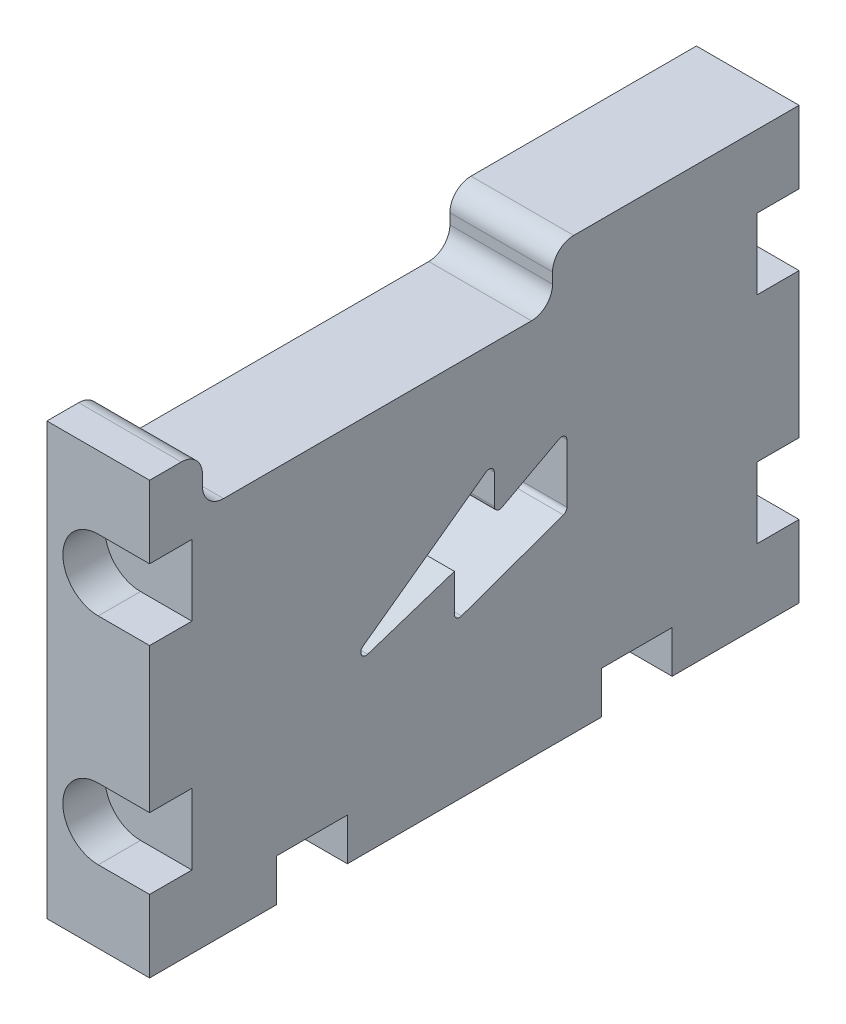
ISO-10303-21;
HEADER;
FILE_DESCRIPTION(('STEP AP214'),'2;1');
FILE_NAME('part.step','',(''),(''),'','','');
FILE_SCHEMA(('AUTOMOTIVE_DESIGN { 1 0 10303 214 1 1 1 1 }'));
ENDSEC;
DATA;
#1=APPLICATION_CONTEXT('core data for automotive mechanical design processes');
#2=APPLICATION_PROTOCOL_DEFINITION('international standard','automotive_design',2000,#1);
#3=PRODUCT_CONTEXT('',#1,'mechanical');
#4=PRODUCT('Part','Part','',(#3));
#5=PRODUCT_RELATED_PRODUCT_CATEGORY('part','',(#4));
#6=PRODUCT_DEFINITION_FORMATION('','',#4);
#7=PRODUCT_DEFINITION_CONTEXT('part definition',#1,'design');
#8=PRODUCT_DEFINITION('design','',#6,#7);
#9=PRODUCT_DEFINITION_SHAPE('','',#8);
#10=(LENGTH_UNIT() NAMED_UNIT(*) SI_UNIT(.MILLI.,.METRE.));
#11=(NAMED_UNIT(*) PLANE_ANGLE_UNIT() SI_UNIT($,.RADIAN.));
#12=(NAMED_UNIT(*) SI_UNIT($,.STERADIAN.) SOLID_ANGLE_UNIT());
#13=UNCERTAINTY_MEASURE_WITH_UNIT(LENGTH_MEASURE(1.E-05),#10,'distance_accuracy_value','');
#14=(GEOMETRIC_REPRESENTATION_CONTEXT(3) GLOBAL_UNCERTAINTY_ASSIGNED_CONTEXT((#13)) GLOBAL_UNIT_ASSIGNED_CONTEXT((#10,
#11,#12)) REPRESENTATION_CONTEXT('',''));
#15=CARTESIAN_POINT('',(0.,0.,0.));
#16=DIRECTION('',(0.,0.,1.));
#17=DIRECTION('',(1.,0.,0.));
#18=AXIS2_PLACEMENT_3D('',#15,#16,#17);
#19=CARTESIAN_POINT('',(-821.069349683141,484.071769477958,0.));
#20=DIRECTION('',(1.,0.,0.));
#21=DIRECTION('',(0.,0.,-1.));
#22=AXIS2_PLACEMENT_3D('',#19,#20,#21);
#23=PLANE('',#22);
#24=CARTESIAN_POINT('',(-821.069349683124,589.475600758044,-42.0718102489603));
#25=DIRECTION('',(1.,0.,0.));
#26=DIRECTION('',(0.,0.,1.));
#27=AXIS2_PLACEMENT_3D('',#24,#25,#26);
#28=CIRCLE('',#27,0.635000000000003);
#29=CARTESIAN_POINT('',(-821.069349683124,589.475600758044,-41.4368102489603));
#30=VERTEX_POINT('',#29);
#31=CARTESIAN_POINT('',(-821.069349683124,588.916063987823,-42.3720494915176));
#32=VERTEX_POINT('',#31);
#33=EDGE_CURVE('E403',#30,#32,#28,.T.);
#34=ORIENTED_EDGE('',*,*,#33,.T.);
#35=DIRECTION('',(0.,0.47281770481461,-0.881160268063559));
#36=VECTOR('',#35,1.);
#37=CARTESIAN_POINT('',(-821.069349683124,588.916063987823,-42.3720494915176));
#38=LINE('',#37,#36);
#39=CARTESIAN_POINT('',(-821.069349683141,592.599879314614,-49.2373416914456));
#40=VERTEX_POINT('',#39);
#41=EDGE_CURVE('E412',#32,#40,#38,.T.);
#42=ORIENTED_EDGE('',*,*,#41,.T.);
#43=CARTESIAN_POINT('',(-821.069349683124,592.040342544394,-49.5375809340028));
#44=DIRECTION('',(-1.,0.,0.));
#45=DIRECTION('',(0.,0.,1.));
#46=AXIS2_PLACEMENT_3D('',#43,#44,#45);
#47=CIRCLE('',#46,0.635000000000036);
#48=CARTESIAN_POINT('',(-821.069349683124,592.040342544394,-50.1725809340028));
#49=VERTEX_POINT('',#48);
#50=EDGE_CURVE('E106',#40,#49,#47,.T.);
#51=ORIENTED_EDGE('',*,*,#50,.T.);
#52=DIRECTION('',(0.,-1.,0.));
#53=VECTOR('',#52,1.);
#54=CARTESIAN_POINT('',(-821.069349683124,592.040342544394,-50.1725809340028));
#55=LINE('',#54,#53);
#56=CARTESIAN_POINT('',(-821.069349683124,585.026034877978,-50.1725809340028));
#57=VERTEX_POINT('',#56);
#58=EDGE_CURVE('E426',#49,#57,#55,.T.);
#59=ORIENTED_EDGE('',*,*,#58,.T.);
#60=CARTESIAN_POINT('',(-821.069349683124,585.026034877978,-49.5375809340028));
#61=DIRECTION('',(-1.,0.,0.));
#62=DIRECTION('',(0.,0.,1.));
#63=AXIS2_PLACEMENT_3D('',#60,#61,#62);
#64=CIRCLE('',#63,0.634999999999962);
#65=CARTESIAN_POINT('',(-821.069349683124,584.428242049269,-49.7517508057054));
#66=VERTEX_POINT('',#65);
#67=EDGE_CURVE('E429',#57,#66,#64,.T.);
#68=ORIENTED_EDGE('',*,*,#67,.T.);
#69=DIRECTION('',(0.,-0.337275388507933,0.941406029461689));
#70=VECTOR('',#69,1.);
#71=CARTESIAN_POINT('',(-821.069349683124,584.428242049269,-49.7517508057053));
#72=LINE('',#71,#70);
#73=CARTESIAN_POINT('',(-821.069349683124,580.035954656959,-37.4919596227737));
#74=VERTEX_POINT('',#73);
#75=EDGE_CURVE('E432',#66,#74,#72,.T.);
#76=ORIENTED_EDGE('',*,*,#75,.T.);
#77=CARTESIAN_POINT('',(-821.069349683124,580.633747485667,-37.2777897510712));
#78=DIRECTION('',(-1.,0.,0.));
#79=DIRECTION('',(0.,0.,1.));
#80=AXIS2_PLACEMENT_3D('',#77,#78,#79);
#81=CIRCLE('',#80,0.634999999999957);
#82=CARTESIAN_POINT('',(-821.069349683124,580.633747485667,-36.6427897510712));
#83=VERTEX_POINT('',#82);
#84=EDGE_CURVE('E435',#74,#83,#81,.T.);
#85=ORIENTED_EDGE('',*,*,#84,.T.);
#86=DIRECTION('',(0.,1.,0.));
#87=VECTOR('',#86,1.);
#88=CARTESIAN_POINT('',(-821.069349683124,580.633747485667,-36.6427897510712));
#89=LINE('',#88,#87);
#90=CARTESIAN_POINT('',(-821.069349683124,585.111680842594,-36.6427897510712));
#91=VERTEX_POINT('',#90);
#92=EDGE_CURVE('E438',#83,#91,#89,.T.);
#93=ORIENTED_EDGE('',*,*,#92,.T.);
#94=DIRECTION('',(0.,-0.311970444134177,0.950091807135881));
#95=VECTOR('',#94,1.);
#96=CARTESIAN_POINT('',(-821.069349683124,585.111680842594,-36.6427897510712));
#97=LINE('',#96,#95);
#98=CARTESIAN_POINT('',(-821.069349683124,581.688428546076,-26.2174304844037));
#99=VERTEX_POINT('',#98);
#100=EDGE_CURVE('E441',#91,#99,#97,.T.);
#101=ORIENTED_EDGE('',*,*,#100,.T.);
#102=CARTESIAN_POINT('',(-821.069349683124,582.291736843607,-26.0193292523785));
#103=DIRECTION('',(-1.,0.,0.));
#104=DIRECTION('',(0.,0.,1.));
#105=AXIS2_PLACEMENT_3D('',#102,#103,#104);
#106=CIRCLE('',#105,0.635000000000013);
#107=CARTESIAN_POINT('',(-821.069349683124,582.805532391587,-25.6461816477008));
#108=VERTEX_POINT('',#107);
#109=EDGE_CURVE('E444',#99,#108,#106,.T.);
#110=ORIENTED_EDGE('',*,*,#109,.T.);
#111=DIRECTION('',(0.,0.58763402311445,-0.80912684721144));
#112=VECTOR('',#111,1.);
#113=CARTESIAN_POINT('',(-821.069349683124,582.805532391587,-25.6461816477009));
#114=LINE('',#113,#112);
#115=CARTESIAN_POINT('',(-821.069349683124,593.54141244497,-40.4286626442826));
#116=VERTEX_POINT('',#115);
#117=EDGE_CURVE('E447',#108,#116,#114,.T.);
#118=ORIENTED_EDGE('',*,*,#117,.T.);
#119=CARTESIAN_POINT('',(-821.069349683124,593.027616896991,-40.8018102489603));
#120=DIRECTION('',(-1.,0.,0.));
#121=DIRECTION('',(0.,0.,1.));
#122=AXIS2_PLACEMENT_3D('',#119,#120,#121);
#123=CIRCLE('',#122,0.634999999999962);
#124=CARTESIAN_POINT('',(-821.069349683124,593.027616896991,-41.4368102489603));
#125=VERTEX_POINT('',#124);
#126=EDGE_CURVE('E450',#116,#125,#123,.T.);
#127=ORIENTED_EDGE('',*,*,#126,.T.);
#128=DIRECTION('',(0.,-1.,0.));
#129=VECTOR('',#128,1.);
#130=CARTESIAN_POINT('',(-821.069349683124,593.027616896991,-41.4368102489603));
#131=LINE('',#130,#129);
#132=EDGE_CURVE('E409',#125,#30,#131,.T.);
#133=ORIENTED_EDGE('',*,*,#132,.T.);
#134=EDGE_LOOP('',(#34,#42,#51,#59,#68,#76,#85,#93,#101,#110,#118,#127,#133));
#135=FACE_BOUND('',#134,.T.);
#136=DIRECTION('',(0.,1.,0.));
#137=VECTOR('',#136,1.);
#138=CARTESIAN_POINT('',(-821.069349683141,484.071769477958,-78.0796));
#139=LINE('',#138,#137);
#140=CARTESIAN_POINT('',(-821.069349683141,561.091856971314,-78.0796));
#141=VERTEX_POINT('',#140);
#142=CARTESIAN_POINT('',(-821.069349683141,569.792756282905,-78.0796));
#143=VERTEX_POINT('',#142);
#144=EDGE_CURVE('E753',#141,#143,#139,.T.);
#145=ORIENTED_EDGE('',*,*,#144,.T.);
#146=DIRECTION('',(0.,0.,-1.));
#147=VECTOR('',#146,1.);
#148=CARTESIAN_POINT('',(-821.069349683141,569.792756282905,-72.9996));
#149=LINE('',#148,#147);
#150=CARTESIAN_POINT('',(-821.069349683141,569.792756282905,-72.9996));
#151=VERTEX_POINT('',#150);
#152=EDGE_CURVE('E534',#151,#143,#149,.T.);
#153=ORIENTED_EDGE('',*,*,#152,.F.);
#154=DIRECTION('',(0.,-1.,0.));
#155=VECTOR('',#154,1.);
#156=CARTESIAN_POINT('',(-821.069349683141,0.,-72.9996));
#157=LINE('',#156,#155);
#158=CARTESIAN_POINT('',(-821.069349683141,578.301756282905,-72.9996));
#159=VERTEX_POINT('',#158);
#160=EDGE_CURVE('E515',#159,#151,#157,.T.);
#161=ORIENTED_EDGE('',*,*,#160,.F.);
#162=DIRECTION('',(0.,0.,-1.));
#163=VECTOR('',#162,1.);
#164=CARTESIAN_POINT('',(-821.069349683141,578.301756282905,-72.9996));
#165=LINE('',#164,#163);
#166=CARTESIAN_POINT('',(-821.069349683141,578.301756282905,-78.0796));
#167=VERTEX_POINT('',#166);
#168=EDGE_CURVE('E536',#159,#167,#165,.T.);
#169=ORIENTED_EDGE('',*,*,#168,.T.);
#170=CARTESIAN_POINT('',(-821.069349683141,595.703554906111,-78.0796));
#171=VERTEX_POINT('',#170);
#172=EDGE_CURVE('E757',#167,#171,#139,.T.);
#173=ORIENTED_EDGE('',*,*,#172,.T.);
#174=DIRECTION('',(0.,0.,-1.));
#175=VECTOR('',#174,1.);
#176=CARTESIAN_POINT('',(-821.069349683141,595.703554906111,-72.9996));
#177=LINE('',#176,#175);
#178=CARTESIAN_POINT('',(-821.069349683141,595.703554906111,-72.9996));
#179=VERTEX_POINT('',#178);
#180=EDGE_CURVE('E562',#179,#171,#177,.T.);
#181=ORIENTED_EDGE('',*,*,#180,.F.);
#182=DIRECTION('',(0.,-1.,0.));
#183=VECTOR('',#182,1.);
#184=CARTESIAN_POINT('',(-821.069349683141,0.,-72.9996));
#185=LINE('',#184,#183);
#186=CARTESIAN_POINT('',(-821.069349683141,604.212554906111,-72.9996));
#187=VERTEX_POINT('',#186);
#188=EDGE_CURVE('E547',#187,#179,#185,.T.);
#189=ORIENTED_EDGE('',*,*,#188,.F.);
#190=DIRECTION('',(0.,0.,-1.));
#191=VECTOR('',#190,1.);
#192=CARTESIAN_POINT('',(-821.069349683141,604.212554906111,-72.9996));
#193=LINE('',#192,#191);
#194=CARTESIAN_POINT('',(-821.069349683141,604.212554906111,-78.0796));
#195=VERTEX_POINT('',#194);
#196=EDGE_CURVE('E564',#187,#195,#193,.T.);
#197=ORIENTED_EDGE('',*,*,#196,.T.);
#198=CARTESIAN_POINT('',(-821.069349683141,612.913454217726,-78.0796));
#199=VERTEX_POINT('',#198);
#200=EDGE_CURVE('E752',#195,#199,#139,.T.);
#201=ORIENTED_EDGE('',*,*,#200,.T.);
#202=DIRECTION('',(0.,0.,-1.));
#203=VECTOR('',#202,1.);
#204=CARTESIAN_POINT('',(-821.069349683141,612.913454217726,0.));
#205=LINE('',#204,#203);
#206=CARTESIAN_POINT('',(-821.069349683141,612.913454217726,-50.9833919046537));
#207=VERTEX_POINT('',#206);
#208=EDGE_CURVE('E748',#207,#199,#205,.T.);
#209=ORIENTED_EDGE('',*,*,#208,.F.);
#210=CARTESIAN_POINT('',(-821.069349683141,610.373454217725,-50.9833919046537));
#211=DIRECTION('',(1.,0.,0.));
#212=DIRECTION('',(0.,0.,-1.));
#213=AXIS2_PLACEMENT_3D('',#210,#211,#212);
#214=CIRCLE('',#213,2.53999999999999);
#215=CARTESIAN_POINT('',(-821.069349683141,610.373454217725,-48.4433919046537));
#216=VERTEX_POINT('',#215);
#217=EDGE_CURVE('E699',#207,#216,#214,.T.);
#218=ORIENTED_EDGE('',*,*,#217,.T.);
#219=DIRECTION('',(0.,-1.,0.));
#220=VECTOR('',#219,1.);
#221=CARTESIAN_POINT('',(-821.069349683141,-5.29359931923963E-13,-48.443391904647));
#222=LINE('',#221,#220);
#223=CARTESIAN_POINT('',(-821.069349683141,609.103454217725,-48.4433919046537));
#224=VERTEX_POINT('',#223);
#225=EDGE_CURVE('E706',#216,#224,#222,.T.);
#226=ORIENTED_EDGE('',*,*,#225,.T.);
#227=CARTESIAN_POINT('',(-821.069349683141,609.103454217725,-45.9033919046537));
#228=DIRECTION('',(1.,0.,0.));
#229=DIRECTION('',(0.,0.,-1.));
#230=AXIS2_PLACEMENT_3D('',#227,#228,#229);
#231=CIRCLE('',#230,2.53999999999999);
#232=CARTESIAN_POINT('',(-821.069349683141,606.563454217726,-45.9033919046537));
#233=VERTEX_POINT('',#232);
#234=EDGE_CURVE('E694',#233,#224,#231,.T.);
#235=ORIENTED_EDGE('',*,*,#234,.F.);
#236=DIRECTION('',(0.,0.,1.));
#237=VECTOR('',#236,1.);
#238=CARTESIAN_POINT('',(-821.069349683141,606.563454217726,0.));
#239=LINE('',#238,#237);
#240=CARTESIAN_POINT('',(-821.069349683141,606.563454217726,-8.89000000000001));
#241=VERTEX_POINT('',#240);
#242=EDGE_CURVE('E725',#233,#241,#239,.T.);
#243=ORIENTED_EDGE('',*,*,#242,.T.);
#244=CARTESIAN_POINT('',(-821.069349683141,609.103454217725,-8.89000000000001));
#245=DIRECTION('',(1.,0.,0.));
#246=DIRECTION('',(0.,0.,-1.));
#247=AXIS2_PLACEMENT_3D('',#244,#245,#246);
#248=CIRCLE('',#247,2.54);
#249=CARTESIAN_POINT('',(-821.069349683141,609.103454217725,-6.35));
#250=VERTEX_POINT('',#249);
#251=EDGE_CURVE('E770',#241,#250,#248,.F.);
#252=ORIENTED_EDGE('',*,*,#251,.T.);
#253=DIRECTION('',(0.,-1.,0.));
#254=VECTOR('',#253,1.);
#255=CARTESIAN_POINT('',(-821.069349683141,484.071769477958,-6.35));
#256=LINE('',#255,#254);
#257=CARTESIAN_POINT('',(-821.069349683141,610.373454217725,-6.35));
#258=VERTEX_POINT('',#257);
#259=EDGE_CURVE('E723',#258,#250,#256,.T.);
#260=ORIENTED_EDGE('',*,*,#259,.F.);
#261=CARTESIAN_POINT('',(-821.069349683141,610.373454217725,-3.81000000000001));
#262=DIRECTION('',(1.,0.,0.));
#263=DIRECTION('',(0.,0.,-1.));
#264=AXIS2_PLACEMENT_3D('',#261,#262,#263);
#265=CIRCLE('',#264,2.54);
#266=CARTESIAN_POINT('',(-821.069349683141,612.913454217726,-3.81000000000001));
#267=VERTEX_POINT('',#266);
#268=EDGE_CURVE('E12',#258,#267,#265,.T.);
#269=ORIENTED_EDGE('',*,*,#268,.T.);
#270=CARTESIAN_POINT('',(-821.069349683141,612.913454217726,0.));
#271=VERTEX_POINT('',#270);
#272=EDGE_CURVE('E749',#271,#267,#205,.T.);
#273=ORIENTED_EDGE('',*,*,#272,.F.);
#274=DIRECTION('',(0.,-1.,0.));
#275=VECTOR('',#274,1.);
#276=CARTESIAN_POINT('',(-821.069349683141,484.071769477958,0.));
#277=LINE('',#276,#275);
#278=CARTESIAN_POINT('',(-821.069349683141,604.212554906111,0.));
#279=VERTEX_POINT('',#278);
#280=EDGE_CURVE('E758',#271,#279,#277,.T.);
#281=ORIENTED_EDGE('',*,*,#280,.T.);
#282=DIRECTION('',(0.,0.,1.));
#283=VECTOR('',#282,1.);
#284=CARTESIAN_POINT('',(-821.069349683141,604.212554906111,-5.08));
#285=LINE('',#284,#283);
#286=CARTESIAN_POINT('',(-821.069349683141,604.212554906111,-5.08));
#287=VERTEX_POINT('',#286);
#288=EDGE_CURVE('E621',#287,#279,#285,.T.);
#289=ORIENTED_EDGE('',*,*,#288,.F.);
#290=DIRECTION('',(0.,1.,0.));
#291=VECTOR('',#290,1.);
#292=CARTESIAN_POINT('',(-821.069349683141,0.,-5.08));
#293=LINE('',#292,#291);
#294=CARTESIAN_POINT('',(-821.069349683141,595.703554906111,-5.08));
#295=VERTEX_POINT('',#294);
#296=EDGE_CURVE('E606',#295,#287,#293,.T.);
#297=ORIENTED_EDGE('',*,*,#296,.F.);
#298=DIRECTION('',(0.,0.,1.));
#299=VECTOR('',#298,1.);
#300=CARTESIAN_POINT('',(-821.069349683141,595.703554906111,-5.08));
#301=LINE('',#300,#299);
#302=CARTESIAN_POINT('',(-821.069349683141,595.703554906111,0.));
#303=VERTEX_POINT('',#302);
#304=EDGE_CURVE('E623',#295,#303,#301,.T.);
#305=ORIENTED_EDGE('',*,*,#304,.T.);
#306=CARTESIAN_POINT('',(-821.069349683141,578.301756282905,0.));
#307=VERTEX_POINT('',#306);
#308=EDGE_CURVE('E762',#303,#307,#277,.T.);
#309=ORIENTED_EDGE('',*,*,#308,.T.);
#310=DIRECTION('',(0.,0.,1.));
#311=VECTOR('',#310,1.);
#312=CARTESIAN_POINT('',(-821.069349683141,578.301756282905,-5.08));
#313=LINE('',#312,#311);
#314=CARTESIAN_POINT('',(-821.069349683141,578.301756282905,-5.08));
#315=VERTEX_POINT('',#314);
#316=EDGE_CURVE('E594',#315,#307,#313,.T.);
#317=ORIENTED_EDGE('',*,*,#316,.F.);
#318=DIRECTION('',(0.,1.,0.));
#319=VECTOR('',#318,1.);
#320=CARTESIAN_POINT('',(-821.069349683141,0.,-5.08));
#321=LINE('',#320,#319);
#322=CARTESIAN_POINT('',(-821.069349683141,569.792756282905,-5.08));
#323=VERTEX_POINT('',#322);
#324=EDGE_CURVE('E575',#323,#315,#321,.T.);
#325=ORIENTED_EDGE('',*,*,#324,.F.);
#326=DIRECTION('',(0.,0.,1.));
#327=VECTOR('',#326,1.);
#328=CARTESIAN_POINT('',(-821.069349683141,569.792756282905,-5.08));
#329=LINE('',#328,#327);
#330=CARTESIAN_POINT('',(-821.069349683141,569.792756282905,0.));
#331=VERTEX_POINT('',#330);
#332=EDGE_CURVE('E596',#323,#331,#329,.T.);
#333=ORIENTED_EDGE('',*,*,#332,.T.);
#334=CARTESIAN_POINT('',(-821.069349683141,561.091856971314,0.));
#335=VERTEX_POINT('',#334);
#336=EDGE_CURVE('E756',#331,#335,#277,.T.);
#337=ORIENTED_EDGE('',*,*,#336,.T.);
#338=DIRECTION('',(0.,0.,1.));
#339=VECTOR('',#338,1.);
#340=CARTESIAN_POINT('',(-821.069349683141,561.091856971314,0.));
#341=LINE('',#340,#339);
#342=CARTESIAN_POINT('',(-821.069349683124,561.091856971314,-15.2653999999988));
#343=VERTEX_POINT('',#342);
#344=EDGE_CURVE('E732',#343,#335,#341,.T.);
#345=ORIENTED_EDGE('',*,*,#344,.F.);
#346=DIRECTION('',(0.,-1.,0.));
#347=VECTOR('',#346,1.);
#348=CARTESIAN_POINT('',(-821.069349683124,566.171856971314,-15.2653999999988));
#349=LINE('',#348,#347);
#350=CARTESIAN_POINT('',(-821.069349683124,566.171856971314,-15.2653999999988));
#351=VERTEX_POINT('',#350);
#352=EDGE_CURVE('E664',#351,#343,#349,.T.);
#353=ORIENTED_EDGE('',*,*,#352,.F.);
#354=DIRECTION('',(0.,0.,1.));
#355=VECTOR('',#354,1.);
#356=CARTESIAN_POINT('',(-821.069349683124,566.171856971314,-15.2653999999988));
#357=LINE('',#356,#355);
#358=CARTESIAN_POINT('',(-821.069349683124,566.171856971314,-23.7743999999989));
#359=VERTEX_POINT('',#358);
#360=EDGE_CURVE('E676',#359,#351,#357,.T.);
#361=ORIENTED_EDGE('',*,*,#360,.F.);
#362=DIRECTION('',(0.,-1.,0.));
#363=VECTOR('',#362,1.);
#364=CARTESIAN_POINT('',(-821.069349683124,566.171856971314,-23.7743999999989));
#365=LINE('',#364,#363);
#366=CARTESIAN_POINT('',(-821.069349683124,561.091856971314,-23.7743999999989));
#367=VERTEX_POINT('',#366);
#368=EDGE_CURVE('E661',#359,#367,#365,.T.);
#369=ORIENTED_EDGE('',*,*,#368,.T.);
#370=CARTESIAN_POINT('',(-821.069349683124,561.091856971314,-54.3051999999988));
#371=VERTEX_POINT('',#370);
#372=EDGE_CURVE('E737',#371,#367,#341,.T.);
#373=ORIENTED_EDGE('',*,*,#372,.F.);
#374=DIRECTION('',(0.,-1.,0.));
#375=VECTOR('',#374,1.);
#376=CARTESIAN_POINT('',(-821.069349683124,566.171856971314,-54.3051999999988));
#377=LINE('',#376,#375);
#378=CARTESIAN_POINT('',(-821.069349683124,566.171856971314,-54.3051999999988));
#379=VERTEX_POINT('',#378);
#380=EDGE_CURVE('E650',#379,#371,#377,.T.);
#381=ORIENTED_EDGE('',*,*,#380,.F.);
#382=DIRECTION('',(0.,0.,1.));
#383=VECTOR('',#382,1.);
#384=CARTESIAN_POINT('',(-821.069349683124,566.171856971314,-54.3051999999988));
#385=LINE('',#384,#383);
#386=CARTESIAN_POINT('',(-821.069349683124,566.171856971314,-62.814199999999));
#387=VERTEX_POINT('',#386);
#388=EDGE_CURVE('E634',#387,#379,#385,.T.);
#389=ORIENTED_EDGE('',*,*,#388,.F.);
#390=DIRECTION('',(0.,-1.,0.));
#391=VECTOR('',#390,1.);
#392=CARTESIAN_POINT('',(-821.069349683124,566.171856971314,-62.814199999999));
#393=LINE('',#392,#391);
#394=CARTESIAN_POINT('',(-821.069349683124,561.091856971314,-62.814199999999));
#395=VERTEX_POINT('',#394);
#396=EDGE_CURVE('E652',#387,#395,#393,.T.);
#397=ORIENTED_EDGE('',*,*,#396,.T.);
#398=EDGE_CURVE('E733',#141,#395,#341,.T.);
#399=ORIENTED_EDGE('',*,*,#398,.F.);
#400=EDGE_LOOP('',(#145,#153,#161,#169,#173,#181,#189,#197,#201,#209,#218,#226,#235,#243,#252,
#260,#269,#273,#281,#289,#297,#305,#309,#317,#325,#333,#337,#345,#353,#361,#369,#373,#381,#389,
#397,#399));
#401=FACE_BOUND('',#400,.T.);
#402=ADVANCED_FACE('F91',(#135,#401),#23,.T.);
#403=CARTESIAN_POINT('',(0.,0.,-78.0796));
#404=DIRECTION('',(0.,0.,-1.));
#405=DIRECTION('',(-1.,0.,0.));
#406=AXIS2_PLACEMENT_3D('',#403,#404,#405);
#407=PLANE('',#406);
#408=CARTESIAN_POINT('',(-827.038349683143,574.047256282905,-78.0796));
#409=DIRECTION('',(0.,0.,-1.));
#410=DIRECTION('',(-1.,0.,0.));
#411=AXIS2_PLACEMENT_3D('',#408,#409,#410);
#412=CIRCLE('',#411,4.25450000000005);
#413=CARTESIAN_POINT('',(-827.038349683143,578.301756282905,-78.0796));
#414=VERTEX_POINT('',#413);
#415=CARTESIAN_POINT('',(-827.038349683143,569.792756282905,-78.0796));
#416=VERTEX_POINT('',#415);
#417=EDGE_CURVE('E521',#414,#416,#412,.F.);
#418=ORIENTED_EDGE('',*,*,#417,.T.);
#419=DIRECTION('',(1.,0.,0.));
#420=VECTOR('',#419,1.);
#421=CARTESIAN_POINT('',(0.,569.792756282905,-78.0796));
#422=LINE('',#421,#420);
#423=EDGE_CURVE('E513',#416,#143,#422,.T.);
#424=ORIENTED_EDGE('',*,*,#423,.T.);
#425=ORIENTED_EDGE('',*,*,#144,.F.);
#426=DIRECTION('',(-1.,0.,0.));
#427=VECTOR('',#426,1.);
#428=CARTESIAN_POINT('',(-899.286453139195,561.091856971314,-78.0796));
#429=LINE('',#428,#427);
#430=CARTESIAN_POINT('',(-833.413749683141,561.091856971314,-78.0796));
#431=VERTEX_POINT('',#430);
#432=EDGE_CURVE('E727',#141,#431,#429,.T.);
#433=ORIENTED_EDGE('',*,*,#432,.T.);
#434=DIRECTION('',(0.,-1.,0.));
#435=VECTOR('',#434,1.);
#436=CARTESIAN_POINT('',(-833.413749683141,0.,-78.0796));
#437=LINE('',#436,#435);
#438=CARTESIAN_POINT('',(-833.413749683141,612.913454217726,-78.0796));
#439=VERTEX_POINT('',#438);
#440=EDGE_CURVE('E685',#439,#431,#437,.T.);
#441=ORIENTED_EDGE('',*,*,#440,.F.);
#442=DIRECTION('',(1.,0.,0.));
#443=VECTOR('',#442,1.);
#444=CARTESIAN_POINT('',(-820.002549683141,612.913454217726,-78.0796));
#445=LINE('',#444,#443);
#446=EDGE_CURVE('E736',#439,#199,#445,.T.);
#447=ORIENTED_EDGE('',*,*,#446,.T.);
#448=ORIENTED_EDGE('',*,*,#200,.F.);
#449=DIRECTION('',(-1.,0.,0.));
#450=VECTOR('',#449,1.);
#451=CARTESIAN_POINT('',(0.,604.212554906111,-78.0796));
#452=LINE('',#451,#450);
#453=CARTESIAN_POINT('',(-827.038349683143,604.212554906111,-78.0796));
#454=VERTEX_POINT('',#453);
#455=EDGE_CURVE('E555',#195,#454,#452,.T.);
#456=ORIENTED_EDGE('',*,*,#455,.T.);
#457=CARTESIAN_POINT('',(-827.038349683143,599.958054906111,-78.0796));
#458=DIRECTION('',(0.,0.,-1.));
#459=DIRECTION('',(-1.,0.,0.));
#460=AXIS2_PLACEMENT_3D('',#457,#458,#459);
#461=CIRCLE('',#460,4.25450000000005);
#462=CARTESIAN_POINT('',(-827.038349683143,595.703554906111,-78.0796));
#463=VERTEX_POINT('',#462);
#464=EDGE_CURVE('E487',#454,#463,#461,.F.);
#465=ORIENTED_EDGE('',*,*,#464,.T.);
#466=DIRECTION('',(1.,0.,0.));
#467=VECTOR('',#466,1.);
#468=CARTESIAN_POINT('',(0.,595.703554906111,-78.0796));
#469=LINE('',#468,#467);
#470=EDGE_CURVE('E545',#463,#171,#469,.T.);
#471=ORIENTED_EDGE('',*,*,#470,.T.);
#472=ORIENTED_EDGE('',*,*,#172,.F.);
#473=DIRECTION('',(-1.,0.,0.));
#474=VECTOR('',#473,1.);
#475=CARTESIAN_POINT('',(0.,578.301756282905,-78.0796));
#476=LINE('',#475,#474);
#477=EDGE_CURVE('E524',#167,#414,#476,.T.);
#478=ORIENTED_EDGE('',*,*,#477,.T.);
#479=EDGE_LOOP('',(#418,#424,#425,#433,#441,#447,#448,#456,#465,#471,#472,#478));
#480=FACE_BOUND('',#479,.T.);
#481=ADVANCED_FACE('F835',(#480),#407,.T.);
#482=CARTESIAN_POINT('',(0.,0.,0.));
#483=DIRECTION('',(0.,0.,1.));
#484=DIRECTION('',(1.,0.,0.));
#485=AXIS2_PLACEMENT_3D('',#482,#483,#484);
#486=PLANE('',#485);
#487=CARTESIAN_POINT('',(-827.241549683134,574.047256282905,0.));
#488=DIRECTION('',(0.,0.,1.));
#489=DIRECTION('',(1.,0.,0.));
#490=AXIS2_PLACEMENT_3D('',#487,#488,#489);
#491=CIRCLE('',#490,4.25450000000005);
#492=CARTESIAN_POINT('',(-827.241549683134,569.792756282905,0.));
#493=VERTEX_POINT('',#492);
#494=CARTESIAN_POINT('',(-827.241549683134,578.301756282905,0.));
#495=VERTEX_POINT('',#494);
#496=EDGE_CURVE('E581',#493,#495,#491,.F.);
#497=ORIENTED_EDGE('',*,*,#496,.T.);
#498=DIRECTION('',(1.,0.,0.));
#499=VECTOR('',#498,1.);
#500=CARTESIAN_POINT('',(1.04021892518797E-11,578.301756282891,0.));
#501=LINE('',#500,#499);
#502=EDGE_CURVE('E573',#495,#307,#501,.T.);
#503=ORIENTED_EDGE('',*,*,#502,.T.);
#504=ORIENTED_EDGE('',*,*,#308,.F.);
#505=DIRECTION('',(-1.,0.,0.));
#506=VECTOR('',#505,1.);
#507=CARTESIAN_POINT('',(1.07152036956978E-11,595.703554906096,0.));
#508=LINE('',#507,#506);
#509=CARTESIAN_POINT('',(-827.241549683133,595.703554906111,0.));
#510=VERTEX_POINT('',#509);
#511=EDGE_CURVE('E614',#303,#510,#508,.T.);
#512=ORIENTED_EDGE('',*,*,#511,.T.);
#513=CARTESIAN_POINT('',(-827.241549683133,599.958054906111,0.));
#514=DIRECTION('',(0.,0.,1.));
#515=DIRECTION('',(1.,0.,0.));
#516=AXIS2_PLACEMENT_3D('',#513,#514,#515);
#517=CIRCLE('',#516,4.25450000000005);
#518=CARTESIAN_POINT('',(-827.241549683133,604.212554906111,0.));
#519=VERTEX_POINT('',#518);
#520=EDGE_CURVE('E533',#510,#519,#517,.F.);
#521=ORIENTED_EDGE('',*,*,#520,.T.);
#522=DIRECTION('',(1.,0.,0.));
#523=VECTOR('',#522,1.);
#524=CARTESIAN_POINT('',(1.08682591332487E-11,604.212554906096,0.));
#525=LINE('',#524,#523);
#526=EDGE_CURVE('E604',#519,#279,#525,.T.);
#527=ORIENTED_EDGE('',*,*,#526,.T.);
#528=ORIENTED_EDGE('',*,*,#280,.F.);
#529=DIRECTION('',(1.,0.,0.));
#530=VECTOR('',#529,1.);
#531=CARTESIAN_POINT('',(0.,612.913454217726,0.));
#532=LINE('',#531,#530);
#533=CARTESIAN_POINT('',(-833.413749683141,612.913454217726,0.));
#534=VERTEX_POINT('',#533);
#535=EDGE_CURVE('E738',#534,#271,#532,.T.);
#536=ORIENTED_EDGE('',*,*,#535,.F.);
#537=DIRECTION('',(0.,1.,0.));
#538=VECTOR('',#537,1.);
#539=CARTESIAN_POINT('',(-833.413749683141,0.,0.));
#540=LINE('',#539,#538);
#541=CARTESIAN_POINT('',(-833.413749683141,561.091856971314,0.));
#542=VERTEX_POINT('',#541);
#543=EDGE_CURVE('E686',#542,#534,#540,.T.);
#544=ORIENTED_EDGE('',*,*,#543,.F.);
#545=DIRECTION('',(1.,0.,0.));
#546=VECTOR('',#545,1.);
#547=CARTESIAN_POINT('',(-899.286453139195,561.091856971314,0.));
#548=LINE('',#547,#546);
#549=EDGE_CURVE('E729',#542,#335,#548,.T.);
#550=ORIENTED_EDGE('',*,*,#549,.T.);
#551=ORIENTED_EDGE('',*,*,#336,.F.);
#552=DIRECTION('',(-1.,0.,0.));
#553=VECTOR('',#552,1.);
#554=CARTESIAN_POINT('',(1.02491338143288E-11,569.792756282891,0.));
#555=LINE('',#554,#553);
#556=EDGE_CURVE('E584',#331,#493,#555,.T.);
#557=ORIENTED_EDGE('',*,*,#556,.T.);
#558=EDGE_LOOP('',(#497,#503,#504,#512,#521,#527,#528,#536,#544,#550,#551,#557));
#559=FACE_BOUND('',#558,.T.);
#560=ADVANCED_FACE('F796',(#559),#486,.T.);
#561=CARTESIAN_POINT('',(-833.413749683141,0.,0.));
#562=DIRECTION('',(-1.,0.,0.));
#563=DIRECTION('',(0.,0.,1.));
#564=AXIS2_PLACEMENT_3D('',#561,#562,#563);
#565=PLANE('',#564);
#566=CARTESIAN_POINT('',(-833.413749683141,589.475600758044,-42.0718102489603));
#567=DIRECTION('',(1.,0.,0.));
#568=DIRECTION('',(0.,0.,1.));
#569=AXIS2_PLACEMENT_3D('',#566,#567,#568);
#570=CIRCLE('',#569,0.635000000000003);
#571=CARTESIAN_POINT('',(-833.413749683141,589.475600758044,-41.4368102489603));
#572=VERTEX_POINT('',#571);
#573=CARTESIAN_POINT('',(-833.413749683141,588.916063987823,-42.3720494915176));
#574=VERTEX_POINT('',#573);
#575=EDGE_CURVE('E114',#572,#574,#570,.T.);
#576=ORIENTED_EDGE('',*,*,#575,.F.);
#577=DIRECTION('',(0.,-1.,0.));
#578=VECTOR('',#577,1.);
#579=CARTESIAN_POINT('',(-833.413749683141,593.027616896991,-41.4368102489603));
#580=LINE('',#579,#578);
#581=CARTESIAN_POINT('',(-833.413749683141,593.027616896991,-41.4368102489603));
#582=VERTEX_POINT('',#581);
#583=EDGE_CURVE('E419',#582,#572,#580,.T.);
#584=ORIENTED_EDGE('',*,*,#583,.F.);
#585=CARTESIAN_POINT('',(-833.413749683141,593.027616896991,-40.8018102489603));
#586=DIRECTION('',(-1.,0.,0.));
#587=DIRECTION('',(0.,0.,1.));
#588=AXIS2_PLACEMENT_3D('',#585,#586,#587);
#589=CIRCLE('',#588,0.634999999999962);
#590=CARTESIAN_POINT('',(-833.413749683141,593.54141244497,-40.4286626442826));
#591=VERTEX_POINT('',#590);
#592=EDGE_CURVE('E422',#591,#582,#589,.T.);
#593=ORIENTED_EDGE('',*,*,#592,.F.);
#594=DIRECTION('',(0.,0.58763402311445,-0.80912684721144));
#595=VECTOR('',#594,1.);
#596=CARTESIAN_POINT('',(-833.413749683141,582.805532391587,-25.6461816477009));
#597=LINE('',#596,#595);
#598=CARTESIAN_POINT('',(-833.413749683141,582.805532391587,-25.6461816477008));
#599=VERTEX_POINT('',#598);
#600=EDGE_CURVE('E480',#599,#591,#597,.T.);
#601=ORIENTED_EDGE('',*,*,#600,.F.);
#602=CARTESIAN_POINT('',(-833.413749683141,582.291736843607,-26.0193292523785));
#603=DIRECTION('',(-1.,0.,0.));
#604=DIRECTION('',(0.,0.,1.));
#605=AXIS2_PLACEMENT_3D('',#602,#603,#604);
#606=CIRCLE('',#605,0.635000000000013);
#607=CARTESIAN_POINT('',(-833.413749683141,581.688428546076,-26.2174304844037));
#608=VERTEX_POINT('',#607);
#609=EDGE_CURVE('E477',#608,#599,#606,.T.);
#610=ORIENTED_EDGE('',*,*,#609,.F.);
#611=DIRECTION('',(0.,-0.311970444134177,0.950091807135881));
#612=VECTOR('',#611,1.);
#613=CARTESIAN_POINT('',(-833.413749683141,585.111680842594,-36.6427897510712));
#614=LINE('',#613,#612);
#615=CARTESIAN_POINT('',(-833.413749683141,585.111680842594,-36.6427897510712));
#616=VERTEX_POINT('',#615);
#617=EDGE_CURVE('E474',#616,#608,#614,.T.);
#618=ORIENTED_EDGE('',*,*,#617,.F.);
#619=DIRECTION('',(0.,1.,0.));
#620=VECTOR('',#619,1.);
#621=CARTESIAN_POINT('',(-833.413749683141,580.633747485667,-36.6427897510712));
#622=LINE('',#621,#620);
#623=CARTESIAN_POINT('',(-833.413749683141,580.633747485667,-36.6427897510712));
#624=VERTEX_POINT('',#623);
#625=EDGE_CURVE('E471',#624,#616,#622,.T.);
#626=ORIENTED_EDGE('',*,*,#625,.F.);
#627=CARTESIAN_POINT('',(-833.413749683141,580.633747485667,-37.2777897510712));
#628=DIRECTION('',(-1.,0.,0.));
#629=DIRECTION('',(0.,0.,1.));
#630=AXIS2_PLACEMENT_3D('',#627,#628,#629);
#631=CIRCLE('',#630,0.634999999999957);
#632=CARTESIAN_POINT('',(-833.413749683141,580.035954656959,-37.4919596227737));
#633=VERTEX_POINT('',#632);
#634=EDGE_CURVE('E468',#633,#624,#631,.T.);
#635=ORIENTED_EDGE('',*,*,#634,.F.);
#636=DIRECTION('',(0.,-0.337275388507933,0.941406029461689));
#637=VECTOR('',#636,1.);
#638=CARTESIAN_POINT('',(-833.413749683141,584.428242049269,-49.7517508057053));
#639=LINE('',#638,#637);
#640=CARTESIAN_POINT('',(-833.413749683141,584.428242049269,-49.7517508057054));
#641=VERTEX_POINT('',#640);
#642=EDGE_CURVE('E465',#641,#633,#639,.T.);
#643=ORIENTED_EDGE('',*,*,#642,.F.);
#644=CARTESIAN_POINT('',(-833.413749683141,585.026034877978,-49.5375809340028));
#645=DIRECTION('',(-1.,0.,0.));
#646=DIRECTION('',(0.,0.,1.));
#647=AXIS2_PLACEMENT_3D('',#644,#645,#646);
#648=CIRCLE('',#647,0.634999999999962);
#649=CARTESIAN_POINT('',(-833.413749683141,585.026034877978,-50.1725809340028));
#650=VERTEX_POINT('',#649);
#651=EDGE_CURVE('E462',#650,#641,#648,.T.);
#652=ORIENTED_EDGE('',*,*,#651,.F.);
#653=DIRECTION('',(0.,-1.,0.));
#654=VECTOR('',#653,1.);
#655=CARTESIAN_POINT('',(-833.413749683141,592.040342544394,-50.1725809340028));
#656=LINE('',#655,#654);
#657=CARTESIAN_POINT('',(-833.413749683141,592.040342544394,-50.1725809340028));
#658=VERTEX_POINT('',#657);
#659=EDGE_CURVE('E459',#658,#650,#656,.T.);
#660=ORIENTED_EDGE('',*,*,#659,.F.);
#661=CARTESIAN_POINT('',(-833.413749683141,592.040342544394,-49.5375809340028));
#662=DIRECTION('',(-1.,0.,0.));
#663=DIRECTION('',(0.,0.,1.));
#664=AXIS2_PLACEMENT_3D('',#661,#662,#663);
#665=CIRCLE('',#664,0.635000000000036);
#666=CARTESIAN_POINT('',(-833.413749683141,592.599879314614,-49.2373416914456));
#667=VERTEX_POINT('',#666);
#668=EDGE_CURVE('E456',#667,#658,#665,.T.);
#669=ORIENTED_EDGE('',*,*,#668,.F.);
#670=DIRECTION('',(0.,0.47281770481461,-0.881160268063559));
#671=VECTOR('',#670,1.);
#672=CARTESIAN_POINT('',(-833.413749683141,588.916063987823,-42.3720494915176));
#673=LINE('',#672,#671);
#674=EDGE_CURVE('E454',#574,#667,#673,.T.);
#675=ORIENTED_EDGE('',*,*,#674,.F.);
#676=EDGE_LOOP('',(#576,#584,#593,#601,#610,#618,#626,#635,#643,#652,#660,#669,#675));
#677=FACE_BOUND('',#676,.T.);
#678=DIRECTION('',(0.,0.,-1.));
#679=VECTOR('',#678,1.);
#680=CARTESIAN_POINT('',(-833.413749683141,561.091856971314,0.));
#681=LINE('',#680,#679);
#682=EDGE_CURVE('E649',#542,#431,#681,.T.);
#683=ORIENTED_EDGE('',*,*,#682,.F.);
#684=ORIENTED_EDGE('',*,*,#543,.T.);
#685=DIRECTION('',(0.,0.,-1.));
#686=VECTOR('',#685,1.);
#687=CARTESIAN_POINT('',(-833.413749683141,612.913454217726,6.35));
#688=LINE('',#687,#686);
#689=CARTESIAN_POINT('',(-833.413749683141,612.913454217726,-3.81000000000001));
#690=VERTEX_POINT('',#689);
#691=EDGE_CURVE('E746',#534,#690,#688,.T.);
#692=ORIENTED_EDGE('',*,*,#691,.T.);
#693=CARTESIAN_POINT('',(-833.413749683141,610.373454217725,-3.81000000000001));
#694=DIRECTION('',(-1.,0.,0.));
#695=DIRECTION('',(0.,0.,1.));
#696=AXIS2_PLACEMENT_3D('',#693,#694,#695);
#697=CIRCLE('',#696,2.54);
#698=CARTESIAN_POINT('',(-833.413749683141,610.373454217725,-6.35));
#699=VERTEX_POINT('',#698);
#700=EDGE_CURVE('E776',#690,#699,#697,.T.);
#701=ORIENTED_EDGE('',*,*,#700,.T.);
#702=DIRECTION('',(0.,1.,0.));
#703=VECTOR('',#702,1.);
#704=CARTESIAN_POINT('',(-833.413749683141,0.,-6.35));
#705=LINE('',#704,#703);
#706=CARTESIAN_POINT('',(-833.413749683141,609.103454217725,-6.35));
#707=VERTEX_POINT('',#706);
#708=EDGE_CURVE('E720',#707,#699,#705,.T.);
#709=ORIENTED_EDGE('',*,*,#708,.F.);
#710=CARTESIAN_POINT('',(-833.413749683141,609.103454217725,-8.89000000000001));
#711=DIRECTION('',(-1.,0.,0.));
#712=DIRECTION('',(0.,0.,1.));
#713=AXIS2_PLACEMENT_3D('',#710,#711,#712);
#714=CIRCLE('',#713,2.54);
#715=CARTESIAN_POINT('',(-833.413749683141,606.563454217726,-8.89000000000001));
#716=VERTEX_POINT('',#715);
#717=EDGE_CURVE('E768',#707,#716,#714,.F.);
#718=ORIENTED_EDGE('',*,*,#717,.T.);
#719=DIRECTION('',(0.,0.,-1.));
#720=VECTOR('',#719,1.);
#721=CARTESIAN_POINT('',(-833.413749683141,606.563454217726,0.));
#722=LINE('',#721,#720);
#723=CARTESIAN_POINT('',(-833.413749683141,606.563454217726,-45.9033919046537));
#724=VERTEX_POINT('',#723);
#725=EDGE_CURVE('E709',#716,#724,#722,.T.);
#726=ORIENTED_EDGE('',*,*,#725,.T.);
#727=CARTESIAN_POINT('',(-833.413749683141,609.103454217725,-45.9033919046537));
#728=DIRECTION('',(-1.,0.,0.));
#729=DIRECTION('',(0.,0.,1.));
#730=AXIS2_PLACEMENT_3D('',#727,#728,#729);
#731=CIRCLE('',#730,2.53999999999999);
#732=CARTESIAN_POINT('',(-833.413749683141,609.103454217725,-48.4433919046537));
#733=VERTEX_POINT('',#732);
#734=EDGE_CURVE('E696',#724,#733,#731,.F.);
#735=ORIENTED_EDGE('',*,*,#734,.T.);
#736=DIRECTION('',(0.,-1.,0.));
#737=VECTOR('',#736,1.);
#738=CARTESIAN_POINT('',(-833.413749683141,-5.29359931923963E-13,-48.443391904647));
#739=LINE('',#738,#737);
#740=CARTESIAN_POINT('',(-833.413749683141,610.373454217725,-48.4433919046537));
#741=VERTEX_POINT('',#740);
#742=EDGE_CURVE('E691',#741,#733,#739,.T.);
#743=ORIENTED_EDGE('',*,*,#742,.F.);
#744=CARTESIAN_POINT('',(-833.413749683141,610.373454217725,-50.9833919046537));
#745=DIRECTION('',(-1.,0.,0.));
#746=DIRECTION('',(0.,0.,1.));
#747=AXIS2_PLACEMENT_3D('',#744,#745,#746);
#748=CIRCLE('',#747,2.53999999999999);
#749=CARTESIAN_POINT('',(-833.413749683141,612.913454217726,-50.9833919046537));
#750=VERTEX_POINT('',#749);
#751=EDGE_CURVE('E701',#750,#741,#748,.F.);
#752=ORIENTED_EDGE('',*,*,#751,.F.);
#753=EDGE_CURVE('E742',#750,#439,#688,.T.);
#754=ORIENTED_EDGE('',*,*,#753,.T.);
#755=ORIENTED_EDGE('',*,*,#440,.T.);
#756=EDGE_LOOP('',(#683,#684,#692,#701,#709,#718,#726,#735,#743,#752,#754,#755));
#757=FACE_BOUND('',#756,.T.);
#758=ADVANCED_FACE('F826',(#677,#757),#565,.T.);
#759=CARTESIAN_POINT('',(0.,612.913454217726,6.35));
#760=DIRECTION('',(0.,1.,0.));
#761=DIRECTION('',(0.,0.,1.));
#762=AXIS2_PLACEMENT_3D('',#759,#760,#761);
#763=PLANE('',#762);
#764=ORIENTED_EDGE('',*,*,#691,.F.);
#765=ORIENTED_EDGE('',*,*,#535,.T.);
#766=ORIENTED_EDGE('',*,*,#272,.T.);
#767=DIRECTION('',(-1.,0.,0.));
#768=VECTOR('',#767,1.);
#769=CARTESIAN_POINT('',(-833.413749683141,612.913454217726,-3.81000000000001));
#770=LINE('',#769,#768);
#771=EDGE_CURVE('E773',#267,#690,#770,.T.);
#772=ORIENTED_EDGE('',*,*,#771,.T.);
#773=EDGE_LOOP('',(#764,#765,#766,#772));
#774=FACE_BOUND('',#773,.T.);
#775=ADVANCED_FACE('F791',(#774),#763,.T.);
#776=ORIENTED_EDGE('',*,*,#446,.F.);
#777=ORIENTED_EDGE('',*,*,#753,.F.);
#778=DIRECTION('',(-1.,0.,0.));
#779=VECTOR('',#778,1.);
#780=CARTESIAN_POINT('',(-794.473945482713,612.913454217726,-50.9833919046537));
#781=LINE('',#780,#779);
#782=EDGE_CURVE('E688',#207,#750,#781,.T.);
#783=ORIENTED_EDGE('',*,*,#782,.F.);
#784=ORIENTED_EDGE('',*,*,#208,.T.);
#785=EDGE_LOOP('',(#776,#777,#783,#784));
#786=FACE_BOUND('',#785,.T.);
#787=ADVANCED_FACE('F856',(#786),#763,.T.);
#788=CARTESIAN_POINT('',(-899.286453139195,561.091856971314,0.));
#789=DIRECTION('',(0.,1.,0.));
#790=DIRECTION('',(0.,0.,1.));
#791=AXIS2_PLACEMENT_3D('',#788,#789,#790);
#792=PLANE('',#791);
#793=CARTESIAN_POINT('',(-827.241549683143,561.091856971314,-58.5596999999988));
#794=DIRECTION('',(0.,-1.,0.));
#795=DIRECTION('',(0.,0.,-1.));
#796=AXIS2_PLACEMENT_3D('',#793,#794,#795);
#797=CIRCLE('',#796,4.25450000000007);
#798=CARTESIAN_POINT('',(-827.241549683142,561.091856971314,-54.3051999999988));
#799=VERTEX_POINT('',#798);
#800=CARTESIAN_POINT('',(-827.241549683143,561.091856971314,-62.8141999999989));
#801=VERTEX_POINT('',#800);
#802=EDGE_CURVE('E640',#799,#801,#797,.T.);
#803=ORIENTED_EDGE('',*,*,#802,.F.);
#804=DIRECTION('',(-1.,0.,0.));
#805=VECTOR('',#804,1.);
#806=CARTESIAN_POINT('',(-827.241549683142,561.091856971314,-54.3051999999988));
#807=LINE('',#806,#805);
#808=EDGE_CURVE('E631',#371,#799,#807,.T.);
#809=ORIENTED_EDGE('',*,*,#808,.F.);
#810=ORIENTED_EDGE('',*,*,#372,.T.);
#811=DIRECTION('',(1.,0.,0.));
#812=VECTOR('',#811,1.);
#813=CARTESIAN_POINT('',(-821.069349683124,561.091856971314,-23.7743999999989));
#814=LINE('',#813,#812);
#815=CARTESIAN_POINT('',(-827.241549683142,561.091856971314,-23.7743999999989));
#816=VERTEX_POINT('',#815);
#817=EDGE_CURVE('E670',#816,#367,#814,.T.);
#818=ORIENTED_EDGE('',*,*,#817,.F.);
#819=CARTESIAN_POINT('',(-827.241549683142,561.091856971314,-19.5198999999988));
#820=DIRECTION('',(0.,-1.,0.));
#821=DIRECTION('',(0.,0.,-1.));
#822=AXIS2_PLACEMENT_3D('',#819,#820,#821);
#823=CIRCLE('',#822,4.25450000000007);
#824=CARTESIAN_POINT('',(-827.241549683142,561.091856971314,-15.2653999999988));
#825=VERTEX_POINT('',#824);
#826=EDGE_CURVE('E643',#825,#816,#823,.T.);
#827=ORIENTED_EDGE('',*,*,#826,.F.);
#828=DIRECTION('',(-1.,0.,0.));
#829=VECTOR('',#828,1.);
#830=CARTESIAN_POINT('',(-827.241549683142,561.091856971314,-15.2653999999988));
#831=LINE('',#830,#829);
#832=EDGE_CURVE('E667',#343,#825,#831,.T.);
#833=ORIENTED_EDGE('',*,*,#832,.F.);
#834=ORIENTED_EDGE('',*,*,#344,.T.);
#835=ORIENTED_EDGE('',*,*,#549,.F.);
#836=ORIENTED_EDGE('',*,*,#682,.T.);
#837=ORIENTED_EDGE('',*,*,#432,.F.);
#838=ORIENTED_EDGE('',*,*,#398,.T.);
#839=DIRECTION('',(1.,0.,0.));
#840=VECTOR('',#839,1.);
#841=CARTESIAN_POINT('',(-821.069349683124,561.091856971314,-62.814199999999));
#842=LINE('',#841,#840);
#843=EDGE_CURVE('E642',#801,#395,#842,.T.);
#844=ORIENTED_EDGE('',*,*,#843,.F.);
#845=EDGE_LOOP('',(#803,#809,#810,#818,#827,#833,#834,#835,#836,#837,#838,#844));
#846=FACE_BOUND('',#845,.T.);
#847=ADVANCED_FACE('F822',(#846),#792,.F.);
#848=CARTESIAN_POINT('',(-755.12810133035,606.563454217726,0.));
#849=DIRECTION('',(0.,1.,0.));
#850=DIRECTION('',(0.,0.,1.));
#851=AXIS2_PLACEMENT_3D('',#848,#849,#850);
#852=PLANE('',#851);
#853=DIRECTION('',(-1.,0.,0.));
#854=VECTOR('',#853,1.);
#855=CARTESIAN_POINT('',(-794.473945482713,606.563454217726,-45.9033919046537));
#856=LINE('',#855,#854);
#857=EDGE_CURVE('E700',#233,#724,#856,.T.);
#858=ORIENTED_EDGE('',*,*,#857,.T.);
#859=ORIENTED_EDGE('',*,*,#725,.F.);
#860=DIRECTION('',(-1.,0.,0.));
#861=VECTOR('',#860,1.);
#862=CARTESIAN_POINT('',(-755.12810133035,606.563454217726,-8.89000000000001));
#863=LINE('',#862,#861);
#864=EDGE_CURVE('E765',#716,#241,#863,.F.);
#865=ORIENTED_EDGE('',*,*,#864,.T.);
#866=ORIENTED_EDGE('',*,*,#242,.F.);
#867=EDGE_LOOP('',(#858,#859,#865,#866));
#868=FACE_BOUND('',#867,.T.);
#869=ADVANCED_FACE('F872',(#868),#852,.T.);
#870=CARTESIAN_POINT('',(-755.12810133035,0.,-6.35));
#871=DIRECTION('',(0.,0.,1.));
#872=DIRECTION('',(1.,0.,0.));
#873=AXIS2_PLACEMENT_3D('',#870,#871,#872);
#874=PLANE('',#873);
#875=ORIENTED_EDGE('',*,*,#708,.T.);
#876=DIRECTION('',(-1.,0.,0.));
#877=VECTOR('',#876,1.);
#878=CARTESIAN_POINT('',(-821.069349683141,610.373454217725,-6.35));
#879=LINE('',#878,#877);
#880=EDGE_CURVE('E99',#699,#258,#879,.F.);
#881=ORIENTED_EDGE('',*,*,#880,.T.);
#882=ORIENTED_EDGE('',*,*,#259,.T.);
#883=DIRECTION('',(-1.,0.,0.));
#884=VECTOR('',#883,1.);
#885=CARTESIAN_POINT('',(-755.12810133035,609.103454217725,-6.35));
#886=LINE('',#885,#884);
#887=EDGE_CURVE('E761',#250,#707,#886,.T.);
#888=ORIENTED_EDGE('',*,*,#887,.T.);
#889=EDGE_LOOP('',(#875,#881,#882,#888));
#890=FACE_BOUND('',#889,.T.);
#891=ADVANCED_FACE('F780',(#890),#874,.F.);
#892=CARTESIAN_POINT('',(-755.12810133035,609.103454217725,-8.89000000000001));
#893=DIRECTION('',(-1.,0.,0.));
#894=DIRECTION('',(0.,0.,1.));
#895=AXIS2_PLACEMENT_3D('',#892,#893,#894);
#896=CYLINDRICAL_SURFACE('',#895,2.54);
#897=ORIENTED_EDGE('',*,*,#251,.F.);
#898=ORIENTED_EDGE('',*,*,#864,.F.);
#899=ORIENTED_EDGE('',*,*,#717,.F.);
#900=ORIENTED_EDGE('',*,*,#887,.F.);
#901=EDGE_LOOP('',(#897,#898,#899,#900));
#902=FACE_BOUND('',#901,.T.);
#903=ADVANCED_FACE('F875',(#902),#896,.F.);
#904=CARTESIAN_POINT('',(0.,610.373454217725,-3.81000000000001));
#905=DIRECTION('',(1.,0.,0.));
#906=DIRECTION('',(0.,0.,-1.));
#907=AXIS2_PLACEMENT_3D('',#904,#905,#906);
#908=CYLINDRICAL_SURFACE('',#907,2.54);
#909=ORIENTED_EDGE('',*,*,#268,.F.);
#910=ORIENTED_EDGE('',*,*,#880,.F.);
#911=ORIENTED_EDGE('',*,*,#700,.F.);
#912=ORIENTED_EDGE('',*,*,#771,.F.);
#913=EDGE_LOOP('',(#909,#910,#911,#912));
#914=FACE_BOUND('',#913,.T.);
#915=ADVANCED_FACE('F93',(#914),#908,.T.);
#916=CARTESIAN_POINT('',(-794.473945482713,610.373454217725,-50.9833919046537));
#917=DIRECTION('',(-1.,0.,0.));
#918=DIRECTION('',(0.,0.,1.));
#919=AXIS2_PLACEMENT_3D('',#916,#917,#918);
#920=CYLINDRICAL_SURFACE('',#919,2.53999999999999);
#921=ORIENTED_EDGE('',*,*,#217,.F.);
#922=ORIENTED_EDGE('',*,*,#782,.T.);
#923=ORIENTED_EDGE('',*,*,#751,.T.);
#924=DIRECTION('',(-1.,0.,0.));
#925=VECTOR('',#924,1.);
#926=CARTESIAN_POINT('',(-794.473945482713,610.373454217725,-48.4433919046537));
#927=LINE('',#926,#925);
#928=EDGE_CURVE('E695',#216,#741,#927,.T.);
#929=ORIENTED_EDGE('',*,*,#928,.F.);
#930=EDGE_LOOP('',(#921,#922,#923,#929));
#931=FACE_BOUND('',#930,.T.);
#932=ADVANCED_FACE('F861',(#931),#920,.T.);
#933=CARTESIAN_POINT('',(-794.473945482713,-5.29359931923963E-13,-48.443391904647));
#934=DIRECTION('',(0.,0.,-1.));
#935=DIRECTION('',(0.,1.,0.));
#936=AXIS2_PLACEMENT_3D('',#933,#934,#935);
#937=PLANE('',#936);
#938=ORIENTED_EDGE('',*,*,#225,.F.);
#939=ORIENTED_EDGE('',*,*,#928,.T.);
#940=ORIENTED_EDGE('',*,*,#742,.T.);
#941=DIRECTION('',(-1.,0.,0.));
#942=VECTOR('',#941,1.);
#943=CARTESIAN_POINT('',(-794.473945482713,609.103454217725,-48.4433919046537));
#944=LINE('',#943,#942);
#945=EDGE_CURVE('E705',#224,#733,#944,.T.);
#946=ORIENTED_EDGE('',*,*,#945,.F.);
#947=EDGE_LOOP('',(#938,#939,#940,#946));
#948=FACE_BOUND('',#947,.T.);
#949=ADVANCED_FACE('F866',(#948),#937,.F.);
#950=CARTESIAN_POINT('',(-794.473945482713,609.103454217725,-45.9033919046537));
#951=DIRECTION('',(-1.,0.,0.));
#952=DIRECTION('',(0.,0.,1.));
#953=AXIS2_PLACEMENT_3D('',#950,#951,#952);
#954=CYLINDRICAL_SURFACE('',#953,2.53999999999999);
#955=ORIENTED_EDGE('',*,*,#857,.F.);
#956=ORIENTED_EDGE('',*,*,#234,.T.);
#957=ORIENTED_EDGE('',*,*,#945,.T.);
#958=ORIENTED_EDGE('',*,*,#734,.F.);
#959=EDGE_LOOP('',(#955,#956,#957,#958));
#960=FACE_BOUND('',#959,.T.);
#961=ADVANCED_FACE('F868',(#960),#954,.F.);
#962=CARTESIAN_POINT('',(-827.241549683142,566.171856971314,-19.5198999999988));
#963=DIRECTION('',(0.,-1.,0.));
#964=DIRECTION('',(0.,0.,-1.));
#965=AXIS2_PLACEMENT_3D('',#962,#963,#964);
#966=CYLINDRICAL_SURFACE('',#965,4.25450000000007);
#967=ORIENTED_EDGE('',*,*,#826,.T.);
#968=DIRECTION('',(0.,-1.,0.));
#969=VECTOR('',#968,1.);
#970=CARTESIAN_POINT('',(-827.241549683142,566.171856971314,-23.7743999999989));
#971=LINE('',#970,#969);
#972=CARTESIAN_POINT('',(-827.241549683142,566.171856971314,-23.7743999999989));
#973=VERTEX_POINT('',#972);
#974=EDGE_CURVE('E657',#973,#816,#971,.T.);
#975=ORIENTED_EDGE('',*,*,#974,.F.);
#976=CARTESIAN_POINT('',(-827.241549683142,566.171856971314,-19.5198999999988));
#977=DIRECTION('',(0.,-1.,0.));
#978=DIRECTION('',(0.,0.,-1.));
#979=AXIS2_PLACEMENT_3D('',#976,#977,#978);
#980=CIRCLE('',#979,4.25450000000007);
#981=CARTESIAN_POINT('',(-827.241549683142,566.171856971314,-15.2653999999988));
#982=VERTEX_POINT('',#981);
#983=EDGE_CURVE('E671',#982,#973,#980,.T.);
#984=ORIENTED_EDGE('',*,*,#983,.F.);
#985=DIRECTION('',(0.,-1.,0.));
#986=VECTOR('',#985,1.);
#987=CARTESIAN_POINT('',(-827.241549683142,566.171856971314,-15.2653999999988));
#988=LINE('',#987,#986);
#989=EDGE_CURVE('E593',#982,#825,#988,.T.);
#990=ORIENTED_EDGE('',*,*,#989,.T.);
#991=EDGE_LOOP('',(#967,#975,#984,#990));
#992=FACE_BOUND('',#991,.T.);
#993=ADVANCED_FACE('F1038',(#992),#966,.F.);
#994=CARTESIAN_POINT('',(-827.241549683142,566.171856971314,-15.2653999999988));
#995=DIRECTION('',(0.,0.,1.));
#996=DIRECTION('',(1.,0.,0.));
#997=AXIS2_PLACEMENT_3D('',#994,#995,#996);
#998=PLANE('',#997);
#999=ORIENTED_EDGE('',*,*,#832,.T.);
#1000=ORIENTED_EDGE('',*,*,#989,.F.);
#1001=DIRECTION('',(-1.,0.,0.));
#1002=VECTOR('',#1001,1.);
#1003=CARTESIAN_POINT('',(-827.241549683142,566.171856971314,-15.2653999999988));
#1004=LINE('',#1003,#1002);
#1005=EDGE_CURVE('E660',#351,#982,#1004,.T.);
#1006=ORIENTED_EDGE('',*,*,#1005,.F.);
#1007=ORIENTED_EDGE('',*,*,#352,.T.);
#1008=EDGE_LOOP('',(#999,#1000,#1006,#1007));
#1009=FACE_BOUND('',#1008,.T.);
#1010=ADVANCED_FACE('F1041',(#1009),#998,.F.);
#1011=CARTESIAN_POINT('',(-821.069349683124,566.171856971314,-23.7743999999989));
#1012=DIRECTION('',(0.,0.,-1.));
#1013=DIRECTION('',(-1.,0.,0.));
#1014=AXIS2_PLACEMENT_3D('',#1011,#1012,#1013);
#1015=PLANE('',#1014);
#1016=ORIENTED_EDGE('',*,*,#817,.T.);
#1017=ORIENTED_EDGE('',*,*,#368,.F.);
#1018=DIRECTION('',(1.,0.,0.));
#1019=VECTOR('',#1018,1.);
#1020=CARTESIAN_POINT('',(-821.069349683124,566.171856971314,-23.7743999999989));
#1021=LINE('',#1020,#1019);
#1022=EDGE_CURVE('E678',#973,#359,#1021,.T.);
#1023=ORIENTED_EDGE('',*,*,#1022,.F.);
#1024=ORIENTED_EDGE('',*,*,#974,.T.);
#1025=EDGE_LOOP('',(#1016,#1017,#1023,#1024));
#1026=FACE_BOUND('',#1025,.T.);
#1027=ADVANCED_FACE('F1043',(#1026),#1015,.F.);
#1028=CARTESIAN_POINT('',(-827.241549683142,566.171856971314,-19.5198999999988));
#1029=DIRECTION('',(0.,-1.,0.));
#1030=DIRECTION('',(0.,0.,-1.));
#1031=AXIS2_PLACEMENT_3D('',#1028,#1029,#1030);
#1032=PLANE('',#1031);
#1033=ORIENTED_EDGE('',*,*,#983,.T.);
#1034=ORIENTED_EDGE('',*,*,#1022,.T.);
#1035=ORIENTED_EDGE('',*,*,#360,.T.);
#1036=ORIENTED_EDGE('',*,*,#1005,.T.);
#1037=EDGE_LOOP('',(#1033,#1034,#1035,#1036));
#1038=FACE_BOUND('',#1037,.T.);
#1039=ADVANCED_FACE('F1036',(#1038),#1032,.T.);
#1040=CARTESIAN_POINT('',(-827.241549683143,566.171856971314,-58.5596999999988));
#1041=DIRECTION('',(0.,-1.,0.));
#1042=DIRECTION('',(0.,0.,-1.));
#1043=AXIS2_PLACEMENT_3D('',#1040,#1041,#1042);
#1044=CYLINDRICAL_SURFACE('',#1043,4.25450000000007);
#1045=ORIENTED_EDGE('',*,*,#802,.T.);
#1046=DIRECTION('',(0.,-1.,0.));
#1047=VECTOR('',#1046,1.);
#1048=CARTESIAN_POINT('',(-827.241549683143,566.171856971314,-62.8141999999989));
#1049=LINE('',#1048,#1047);
#1050=CARTESIAN_POINT('',(-827.241549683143,566.171856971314,-62.8141999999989));
#1051=VERTEX_POINT('',#1050);
#1052=EDGE_CURVE('E639',#1051,#801,#1049,.T.);
#1053=ORIENTED_EDGE('',*,*,#1052,.F.);
#1054=CARTESIAN_POINT('',(-827.241549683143,566.171856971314,-58.5596999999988));
#1055=DIRECTION('',(0.,-1.,0.));
#1056=DIRECTION('',(0.,0.,-1.));
#1057=AXIS2_PLACEMENT_3D('',#1054,#1055,#1056);
#1058=CIRCLE('',#1057,4.25450000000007);
#1059=CARTESIAN_POINT('',(-827.241549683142,566.171856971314,-54.3051999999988));
#1060=VERTEX_POINT('',#1059);
#1061=EDGE_CURVE('E627',#1060,#1051,#1058,.T.);
#1062=ORIENTED_EDGE('',*,*,#1061,.F.);
#1063=DIRECTION('',(0.,-1.,0.));
#1064=VECTOR('',#1063,1.);
#1065=CARTESIAN_POINT('',(-827.241549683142,566.171856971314,-54.3051999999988));
#1066=LINE('',#1065,#1064);
#1067=EDGE_CURVE('E647',#1060,#799,#1066,.T.);
#1068=ORIENTED_EDGE('',*,*,#1067,.T.);
#1069=EDGE_LOOP('',(#1045,#1053,#1062,#1068));
#1070=FACE_BOUND('',#1069,.T.);
#1071=ADVANCED_FACE('F1029',(#1070),#1044,.F.);
#1072=CARTESIAN_POINT('',(-827.241549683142,566.171856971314,-54.3051999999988));
#1073=DIRECTION('',(0.,0.,1.));
#1074=DIRECTION('',(1.,0.,0.));
#1075=AXIS2_PLACEMENT_3D('',#1072,#1073,#1074);
#1076=PLANE('',#1075);
#1077=ORIENTED_EDGE('',*,*,#808,.T.);
#1078=ORIENTED_EDGE('',*,*,#1067,.F.);
#1079=DIRECTION('',(-1.,0.,0.));
#1080=VECTOR('',#1079,1.);
#1081=CARTESIAN_POINT('',(-827.241549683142,566.171856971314,-54.3051999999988));
#1082=LINE('',#1081,#1080);
#1083=EDGE_CURVE('E636',#379,#1060,#1082,.T.);
#1084=ORIENTED_EDGE('',*,*,#1083,.F.);
#1085=ORIENTED_EDGE('',*,*,#380,.T.);
#1086=EDGE_LOOP('',(#1077,#1078,#1084,#1085));
#1087=FACE_BOUND('',#1086,.T.);
#1088=ADVANCED_FACE('F1026',(#1087),#1076,.F.);
#1089=CARTESIAN_POINT('',(-821.069349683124,566.171856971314,-62.814199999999));
#1090=DIRECTION('',(0.,0.,-1.));
#1091=DIRECTION('',(-1.,0.,0.));
#1092=AXIS2_PLACEMENT_3D('',#1089,#1090,#1091);
#1093=PLANE('',#1092);
#1094=ORIENTED_EDGE('',*,*,#843,.T.);
#1095=ORIENTED_EDGE('',*,*,#396,.F.);
#1096=DIRECTION('',(1.,0.,0.));
#1097=VECTOR('',#1096,1.);
#1098=CARTESIAN_POINT('',(-821.069349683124,566.171856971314,-62.814199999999));
#1099=LINE('',#1098,#1097);
#1100=EDGE_CURVE('E630',#1051,#387,#1099,.T.);
#1101=ORIENTED_EDGE('',*,*,#1100,.F.);
#1102=ORIENTED_EDGE('',*,*,#1052,.T.);
#1103=EDGE_LOOP('',(#1094,#1095,#1101,#1102));
#1104=FACE_BOUND('',#1103,.T.);
#1105=ADVANCED_FACE('F1024',(#1104),#1093,.F.);
#1106=CARTESIAN_POINT('',(-827.241549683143,566.171856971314,-58.5596999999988));
#1107=DIRECTION('',(0.,-1.,0.));
#1108=DIRECTION('',(0.,0.,-1.));
#1109=AXIS2_PLACEMENT_3D('',#1106,#1107,#1108);
#1110=PLANE('',#1109);
#1111=ORIENTED_EDGE('',*,*,#1061,.T.);
#1112=ORIENTED_EDGE('',*,*,#1100,.T.);
#1113=ORIENTED_EDGE('',*,*,#388,.T.);
#1114=ORIENTED_EDGE('',*,*,#1083,.T.);
#1115=EDGE_LOOP('',(#1111,#1112,#1113,#1114));
#1116=FACE_BOUND('',#1115,.T.);
#1117=ADVANCED_FACE('F1021',(#1116),#1110,.T.);
#1118=CARTESIAN_POINT('',(-827.241549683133,599.958054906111,-5.08));
#1119=DIRECTION('',(0.,0.,1.));
#1120=DIRECTION('',(1.,0.,0.));
#1121=AXIS2_PLACEMENT_3D('',#1118,#1119,#1120);
#1122=CYLINDRICAL_SURFACE('',#1121,4.25450000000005);
#1123=ORIENTED_EDGE('',*,*,#520,.F.);
#1124=DIRECTION('',(0.,0.,1.));
#1125=VECTOR('',#1124,1.);
#1126=CARTESIAN_POINT('',(-827.241549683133,595.703554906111,-5.08));
#1127=LINE('',#1126,#1125);
#1128=CARTESIAN_POINT('',(-827.241549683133,595.703554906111,-5.08));
#1129=VERTEX_POINT('',#1128);
#1130=EDGE_CURVE('E611',#1129,#510,#1127,.T.);
#1131=ORIENTED_EDGE('',*,*,#1130,.F.);
#1132=CARTESIAN_POINT('',(-827.241549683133,599.958054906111,-5.08));
#1133=DIRECTION('',(0.,0.,1.));
#1134=DIRECTION('',(1.,0.,0.));
#1135=AXIS2_PLACEMENT_3D('',#1132,#1133,#1134);
#1136=CIRCLE('',#1135,4.25450000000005);
#1137=CARTESIAN_POINT('',(-827.241549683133,604.212554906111,-5.08));
#1138=VERTEX_POINT('',#1137);
#1139=EDGE_CURVE('E600',#1129,#1138,#1136,.F.);
#1140=ORIENTED_EDGE('',*,*,#1139,.T.);
#1141=DIRECTION('',(0.,0.,1.));
#1142=VECTOR('',#1141,1.);
#1143=CARTESIAN_POINT('',(-827.241549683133,604.212554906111,-5.08));
#1144=LINE('',#1143,#1142);
#1145=EDGE_CURVE('E585',#1138,#519,#1144,.T.);
#1146=ORIENTED_EDGE('',*,*,#1145,.T.);
#1147=EDGE_LOOP('',(#1123,#1131,#1140,#1146));
#1148=FACE_BOUND('',#1147,.T.);
#1149=ADVANCED_FACE('F803',(#1148),#1122,.F.);
#1150=CARTESIAN_POINT('',(1.08682591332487E-11,604.212554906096,-5.08));
#1151=DIRECTION('',(0.,-1.,0.));
#1152=DIRECTION('',(1.,0.,0.));
#1153=AXIS2_PLACEMENT_3D('',#1150,#1151,#1152);
#1154=PLANE('',#1153);
#1155=ORIENTED_EDGE('',*,*,#526,.F.);
#1156=ORIENTED_EDGE('',*,*,#1145,.F.);
#1157=DIRECTION('',(1.,0.,0.));
#1158=VECTOR('',#1157,1.);
#1159=CARTESIAN_POINT('',(1.08682591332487E-11,604.212554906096,-5.08));
#1160=LINE('',#1159,#1158);
#1161=EDGE_CURVE('E609',#1138,#287,#1160,.T.);
#1162=ORIENTED_EDGE('',*,*,#1161,.T.);
#1163=ORIENTED_EDGE('',*,*,#288,.T.);
#1164=EDGE_LOOP('',(#1155,#1156,#1162,#1163));
#1165=FACE_BOUND('',#1164,.T.);
#1166=ADVANCED_FACE('F801',(#1165),#1154,.T.);
#1167=CARTESIAN_POINT('',(1.07152036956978E-11,595.703554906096,-5.08));
#1168=DIRECTION('',(0.,1.,0.));
#1169=DIRECTION('',(-1.,0.,0.));
#1170=AXIS2_PLACEMENT_3D('',#1167,#1168,#1169);
#1171=PLANE('',#1170);
#1172=ORIENTED_EDGE('',*,*,#511,.F.);
#1173=ORIENTED_EDGE('',*,*,#304,.F.);
#1174=DIRECTION('',(-1.,0.,0.));
#1175=VECTOR('',#1174,1.);
#1176=CARTESIAN_POINT('',(1.07152036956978E-11,595.703554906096,-5.08));
#1177=LINE('',#1176,#1175);
#1178=EDGE_CURVE('E603',#295,#1129,#1177,.T.);
#1179=ORIENTED_EDGE('',*,*,#1178,.T.);
#1180=ORIENTED_EDGE('',*,*,#1130,.T.);
#1181=EDGE_LOOP('',(#1172,#1173,#1179,#1180));
#1182=FACE_BOUND('',#1181,.T.);
#1183=ADVANCED_FACE('F1014',(#1182),#1171,.T.);
#1184=CARTESIAN_POINT('',(0.,0.,-5.08));
#1185=DIRECTION('',(0.,0.,1.));
#1186=DIRECTION('',(1.,0.,0.));
#1187=AXIS2_PLACEMENT_3D('',#1184,#1185,#1186);
#1188=PLANE('',#1187);
#1189=ORIENTED_EDGE('',*,*,#1139,.F.);
#1190=ORIENTED_EDGE('',*,*,#1178,.F.);
#1191=ORIENTED_EDGE('',*,*,#296,.T.);
#1192=ORIENTED_EDGE('',*,*,#1161,.F.);
#1193=EDGE_LOOP('',(#1189,#1190,#1191,#1192));
#1194=FACE_BOUND('',#1193,.T.);
#1195=ADVANCED_FACE('F807',(#1194),#1188,.T.);
#1196=CARTESIAN_POINT('',(-827.241549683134,574.047256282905,-5.08));
#1197=DIRECTION('',(0.,0.,1.));
#1198=DIRECTION('',(1.,0.,0.));
#1199=AXIS2_PLACEMENT_3D('',#1196,#1197,#1198);
#1200=CYLINDRICAL_SURFACE('',#1199,4.25450000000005);
#1201=ORIENTED_EDGE('',*,*,#496,.F.);
#1202=DIRECTION('',(0.,0.,1.));
#1203=VECTOR('',#1202,1.);
#1204=CARTESIAN_POINT('',(-827.241549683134,569.792756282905,-5.08));
#1205=LINE('',#1204,#1203);
#1206=CARTESIAN_POINT('',(-827.241549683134,569.792756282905,-5.08));
#1207=VERTEX_POINT('',#1206);
#1208=EDGE_CURVE('E580',#1207,#493,#1205,.T.);
#1209=ORIENTED_EDGE('',*,*,#1208,.F.);
#1210=CARTESIAN_POINT('',(-827.241549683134,574.047256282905,-5.08));
#1211=DIRECTION('',(0.,0.,1.));
#1212=DIRECTION('',(1.,0.,0.));
#1213=AXIS2_PLACEMENT_3D('',#1210,#1211,#1212);
#1214=CIRCLE('',#1213,4.25450000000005);
#1215=CARTESIAN_POINT('',(-827.241549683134,578.301756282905,-5.08));
#1216=VERTEX_POINT('',#1215);
#1217=EDGE_CURVE('E569',#1207,#1216,#1214,.F.);
#1218=ORIENTED_EDGE('',*,*,#1217,.T.);
#1219=DIRECTION('',(0.,0.,1.));
#1220=VECTOR('',#1219,1.);
#1221=CARTESIAN_POINT('',(-827.241549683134,578.301756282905,-5.08));
#1222=LINE('',#1221,#1220);
#1223=EDGE_CURVE('E590',#1216,#495,#1222,.T.);
#1224=ORIENTED_EDGE('',*,*,#1223,.T.);
#1225=EDGE_LOOP('',(#1201,#1209,#1218,#1224));
#1226=FACE_BOUND('',#1225,.T.);
#1227=ADVANCED_FACE('F1004',(#1226),#1200,.F.);
#1228=CARTESIAN_POINT('',(1.04021892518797E-11,578.301756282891,-5.08));
#1229=DIRECTION('',(0.,-1.,0.));
#1230=DIRECTION('',(1.,0.,0.));
#1231=AXIS2_PLACEMENT_3D('',#1228,#1229,#1230);
#1232=PLANE('',#1231);
#1233=ORIENTED_EDGE('',*,*,#502,.F.);
#1234=ORIENTED_EDGE('',*,*,#1223,.F.);
#1235=DIRECTION('',(1.,0.,0.));
#1236=VECTOR('',#1235,1.);
#1237=CARTESIAN_POINT('',(1.04021892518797E-11,578.301756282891,-5.08));
#1238=LINE('',#1237,#1236);
#1239=EDGE_CURVE('E578',#1216,#315,#1238,.T.);
#1240=ORIENTED_EDGE('',*,*,#1239,.T.);
#1241=ORIENTED_EDGE('',*,*,#316,.T.);
#1242=EDGE_LOOP('',(#1233,#1234,#1240,#1241));
#1243=FACE_BOUND('',#1242,.T.);
#1244=ADVANCED_FACE('F1001',(#1243),#1232,.T.);
#1245=CARTESIAN_POINT('',(1.02491338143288E-11,569.792756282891,-5.08));
#1246=DIRECTION('',(0.,1.,0.));
#1247=DIRECTION('',(-1.,0.,0.));
#1248=AXIS2_PLACEMENT_3D('',#1245,#1246,#1247);
#1249=PLANE('',#1248);
#1250=ORIENTED_EDGE('',*,*,#556,.F.);
#1251=ORIENTED_EDGE('',*,*,#332,.F.);
#1252=DIRECTION('',(-1.,0.,0.));
#1253=VECTOR('',#1252,1.);
#1254=CARTESIAN_POINT('',(1.02491338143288E-11,569.792756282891,-5.08));
#1255=LINE('',#1254,#1253);
#1256=EDGE_CURVE('E572',#323,#1207,#1255,.T.);
#1257=ORIENTED_EDGE('',*,*,#1256,.T.);
#1258=ORIENTED_EDGE('',*,*,#1208,.T.);
#1259=EDGE_LOOP('',(#1250,#1251,#1257,#1258));
#1260=FACE_BOUND('',#1259,.T.);
#1261=ADVANCED_FACE('F999',(#1260),#1249,.T.);
#1262=CARTESIAN_POINT('',(0.,0.,-5.08));
#1263=DIRECTION('',(0.,0.,1.));
#1264=DIRECTION('',(1.,0.,0.));
#1265=AXIS2_PLACEMENT_3D('',#1262,#1263,#1264);
#1266=PLANE('',#1265);
#1267=ORIENTED_EDGE('',*,*,#1217,.F.);
#1268=ORIENTED_EDGE('',*,*,#1256,.F.);
#1269=ORIENTED_EDGE('',*,*,#324,.T.);
#1270=ORIENTED_EDGE('',*,*,#1239,.F.);
#1271=EDGE_LOOP('',(#1267,#1268,#1269,#1270));
#1272=FACE_BOUND('',#1271,.T.);
#1273=ADVANCED_FACE('F995',(#1272),#1266,.T.);
#1274=CARTESIAN_POINT('',(-827.038349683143,599.958054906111,-72.9996));
#1275=DIRECTION('',(0.,0.,-1.));
#1276=DIRECTION('',(-1.,0.,0.));
#1277=AXIS2_PLACEMENT_3D('',#1274,#1275,#1276);
#1278=CYLINDRICAL_SURFACE('',#1277,4.25450000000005);
#1279=ORIENTED_EDGE('',*,*,#464,.F.);
#1280=DIRECTION('',(0.,0.,-1.));
#1281=VECTOR('',#1280,1.);
#1282=CARTESIAN_POINT('',(-827.038349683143,604.212554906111,-72.9996));
#1283=LINE('',#1282,#1281);
#1284=CARTESIAN_POINT('',(-827.038349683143,604.212554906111,-72.9996));
#1285=VERTEX_POINT('',#1284);
#1286=EDGE_CURVE('E552',#1285,#454,#1283,.T.);
#1287=ORIENTED_EDGE('',*,*,#1286,.F.);
#1288=CARTESIAN_POINT('',(-827.038349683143,599.958054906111,-72.9996));
#1289=DIRECTION('',(0.,0.,-1.));
#1290=DIRECTION('',(-1.,0.,0.));
#1291=AXIS2_PLACEMENT_3D('',#1288,#1289,#1290);
#1292=CIRCLE('',#1291,4.25450000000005);
#1293=CARTESIAN_POINT('',(-827.038349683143,595.703554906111,-72.9996));
#1294=VERTEX_POINT('',#1293);
#1295=EDGE_CURVE('E541',#1285,#1294,#1292,.F.);
#1296=ORIENTED_EDGE('',*,*,#1295,.T.);
#1297=DIRECTION('',(0.,0.,-1.));
#1298=VECTOR('',#1297,1.);
#1299=CARTESIAN_POINT('',(-827.038349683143,595.703554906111,-72.9996));
#1300=LINE('',#1299,#1298);
#1301=EDGE_CURVE('E525',#1294,#463,#1300,.T.);
#1302=ORIENTED_EDGE('',*,*,#1301,.T.);
#1303=EDGE_LOOP('',(#1279,#1287,#1296,#1302));
#1304=FACE_BOUND('',#1303,.T.);
#1305=ADVANCED_FACE('F988',(#1304),#1278,.F.);
#1306=CARTESIAN_POINT('',(0.,595.703554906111,-72.9996));
#1307=DIRECTION('',(0.,1.,0.));
#1308=DIRECTION('',(0.,0.,1.));
#1309=AXIS2_PLACEMENT_3D('',#1306,#1307,#1308);
#1310=PLANE('',#1309);
#1311=ORIENTED_EDGE('',*,*,#470,.F.);
#1312=ORIENTED_EDGE('',*,*,#1301,.F.);
#1313=DIRECTION('',(1.,0.,0.));
#1314=VECTOR('',#1313,1.);
#1315=CARTESIAN_POINT('',(0.,595.703554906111,-72.9996));
#1316=LINE('',#1315,#1314);
#1317=EDGE_CURVE('E550',#1294,#179,#1316,.T.);
#1318=ORIENTED_EDGE('',*,*,#1317,.T.);
#1319=ORIENTED_EDGE('',*,*,#180,.T.);
#1320=EDGE_LOOP('',(#1311,#1312,#1318,#1319));
#1321=FACE_BOUND('',#1320,.T.);
#1322=ADVANCED_FACE('F985',(#1321),#1310,.T.);
#1323=CARTESIAN_POINT('',(0.,604.212554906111,-72.9996));
#1324=DIRECTION('',(0.,-1.,0.));
#1325=DIRECTION('',(0.,0.,-1.));
#1326=AXIS2_PLACEMENT_3D('',#1323,#1324,#1325);
#1327=PLANE('',#1326);
#1328=ORIENTED_EDGE('',*,*,#455,.F.);
#1329=ORIENTED_EDGE('',*,*,#196,.F.);
#1330=DIRECTION('',(-1.,0.,0.));
#1331=VECTOR('',#1330,1.);
#1332=CARTESIAN_POINT('',(0.,604.212554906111,-72.9996));
#1333=LINE('',#1332,#1331);
#1334=EDGE_CURVE('E544',#187,#1285,#1333,.T.);
#1335=ORIENTED_EDGE('',*,*,#1334,.T.);
#1336=ORIENTED_EDGE('',*,*,#1286,.T.);
#1337=EDGE_LOOP('',(#1328,#1329,#1335,#1336));
#1338=FACE_BOUND('',#1337,.T.);
#1339=ADVANCED_FACE('F983',(#1338),#1327,.T.);
#1340=CARTESIAN_POINT('',(0.,0.,-72.9996));
#1341=DIRECTION('',(0.,0.,-1.));
#1342=DIRECTION('',(-1.,0.,0.));
#1343=AXIS2_PLACEMENT_3D('',#1340,#1341,#1342);
#1344=PLANE('',#1343);
#1345=ORIENTED_EDGE('',*,*,#1295,.F.);
#1346=ORIENTED_EDGE('',*,*,#1334,.F.);
#1347=ORIENTED_EDGE('',*,*,#188,.T.);
#1348=ORIENTED_EDGE('',*,*,#1317,.F.);
#1349=EDGE_LOOP('',(#1345,#1346,#1347,#1348));
#1350=FACE_BOUND('',#1349,.T.);
#1351=ADVANCED_FACE('F980',(#1350),#1344,.T.);
#1352=CARTESIAN_POINT('',(-827.038349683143,574.047256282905,-72.9996));
#1353=DIRECTION('',(0.,0.,-1.));
#1354=DIRECTION('',(-1.,0.,0.));
#1355=AXIS2_PLACEMENT_3D('',#1352,#1353,#1354);
#1356=CYLINDRICAL_SURFACE('',#1355,4.25450000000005);
#1357=ORIENTED_EDGE('',*,*,#417,.F.);
#1358=DIRECTION('',(0.,0.,-1.));
#1359=VECTOR('',#1358,1.);
#1360=CARTESIAN_POINT('',(-827.038349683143,578.301756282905,-72.9996));
#1361=LINE('',#1360,#1359);
#1362=CARTESIAN_POINT('',(-827.038349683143,578.301756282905,-72.9996));
#1363=VERTEX_POINT('',#1362);
#1364=EDGE_CURVE('E520',#1363,#414,#1361,.T.);
#1365=ORIENTED_EDGE('',*,*,#1364,.F.);
#1366=CARTESIAN_POINT('',(-827.038349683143,574.047256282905,-72.9996));
#1367=DIRECTION('',(0.,0.,-1.));
#1368=DIRECTION('',(-1.,0.,0.));
#1369=AXIS2_PLACEMENT_3D('',#1366,#1367,#1368);
#1370=CIRCLE('',#1369,4.25450000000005);
#1371=CARTESIAN_POINT('',(-827.038349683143,569.792756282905,-72.9996));
#1372=VERTEX_POINT('',#1371);
#1373=EDGE_CURVE('E509',#1363,#1372,#1370,.F.);
#1374=ORIENTED_EDGE('',*,*,#1373,.T.);
#1375=DIRECTION('',(0.,0.,-1.));
#1376=VECTOR('',#1375,1.);
#1377=CARTESIAN_POINT('',(-827.038349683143,569.792756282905,-72.9996));
#1378=LINE('',#1377,#1376);
#1379=EDGE_CURVE('E530',#1372,#416,#1378,.T.);
#1380=ORIENTED_EDGE('',*,*,#1379,.T.);
#1381=EDGE_LOOP('',(#1357,#1365,#1374,#1380));
#1382=FACE_BOUND('',#1381,.T.);
#1383=ADVANCED_FACE('F840',(#1382),#1356,.F.);
#1384=CARTESIAN_POINT('',(0.,569.792756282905,-72.9996));
#1385=DIRECTION('',(0.,1.,0.));
#1386=DIRECTION('',(0.,0.,1.));
#1387=AXIS2_PLACEMENT_3D('',#1384,#1385,#1386);
#1388=PLANE('',#1387);
#1389=ORIENTED_EDGE('',*,*,#423,.F.);
#1390=ORIENTED_EDGE('',*,*,#1379,.F.);
#1391=DIRECTION('',(1.,0.,0.));
#1392=VECTOR('',#1391,1.);
#1393=CARTESIAN_POINT('',(0.,569.792756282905,-72.9996));
#1394=LINE('',#1393,#1392);
#1395=EDGE_CURVE('E518',#1372,#151,#1394,.T.);
#1396=ORIENTED_EDGE('',*,*,#1395,.T.);
#1397=ORIENTED_EDGE('',*,*,#152,.T.);
#1398=EDGE_LOOP('',(#1389,#1390,#1396,#1397));
#1399=FACE_BOUND('',#1398,.T.);
#1400=ADVANCED_FACE('F838',(#1399),#1388,.T.);
#1401=CARTESIAN_POINT('',(0.,578.301756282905,-72.9996));
#1402=DIRECTION('',(0.,-1.,0.));
#1403=DIRECTION('',(0.,0.,-1.));
#1404=AXIS2_PLACEMENT_3D('',#1401,#1402,#1403);
#1405=PLANE('',#1404);
#1406=ORIENTED_EDGE('',*,*,#477,.F.);
#1407=ORIENTED_EDGE('',*,*,#168,.F.);
#1408=DIRECTION('',(-1.,0.,0.));
#1409=VECTOR('',#1408,1.);
#1410=CARTESIAN_POINT('',(0.,578.301756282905,-72.9996));
#1411=LINE('',#1410,#1409);
#1412=EDGE_CURVE('E512',#159,#1363,#1411,.T.);
#1413=ORIENTED_EDGE('',*,*,#1412,.T.);
#1414=ORIENTED_EDGE('',*,*,#1364,.T.);
#1415=EDGE_LOOP('',(#1406,#1407,#1413,#1414));
#1416=FACE_BOUND('',#1415,.T.);
#1417=ADVANCED_FACE('F973',(#1416),#1405,.T.);
#1418=CARTESIAN_POINT('',(0.,0.,-72.9996));
#1419=DIRECTION('',(0.,0.,-1.));
#1420=DIRECTION('',(-1.,0.,0.));
#1421=AXIS2_PLACEMENT_3D('',#1418,#1419,#1420);
#1422=PLANE('',#1421);
#1423=ORIENTED_EDGE('',*,*,#1373,.F.);
#1424=ORIENTED_EDGE('',*,*,#1412,.F.);
#1425=ORIENTED_EDGE('',*,*,#160,.T.);
#1426=ORIENTED_EDGE('',*,*,#1395,.F.);
#1427=EDGE_LOOP('',(#1423,#1424,#1425,#1426));
#1428=FACE_BOUND('',#1427,.T.);
#1429=ADVANCED_FACE('F845',(#1428),#1422,.T.);
#1430=CARTESIAN_POINT('',(-821.069349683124,589.475600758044,-42.0718102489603));
#1431=DIRECTION('',(-1.,0.,0.));
#1432=DIRECTION('',(0.,0.,1.));
#1433=AXIS2_PLACEMENT_3D('',#1430,#1431,#1432);
#1434=CYLINDRICAL_SURFACE('',#1433,0.635000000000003);
#1435=ORIENTED_EDGE('',*,*,#575,.T.);
#1436=DIRECTION('',(-1.,0.,0.));
#1437=VECTOR('',#1436,1.);
#1438=CARTESIAN_POINT('',(-821.069349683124,588.916063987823,-42.3720494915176));
#1439=LINE('',#1438,#1437);
#1440=EDGE_CURVE('E399',#32,#574,#1439,.T.);
#1441=ORIENTED_EDGE('',*,*,#1440,.F.);
#1442=ORIENTED_EDGE('',*,*,#33,.F.);
#1443=DIRECTION('',(-1.,0.,0.));
#1444=VECTOR('',#1443,1.);
#1445=CARTESIAN_POINT('',(-821.069349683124,589.475600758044,-41.4368102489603));
#1446=LINE('',#1445,#1444);
#1447=EDGE_CURVE('E485',#30,#572,#1446,.T.);
#1448=ORIENTED_EDGE('',*,*,#1447,.T.);
#1449=EDGE_LOOP('',(#1435,#1441,#1442,#1448));
#1450=FACE_BOUND('',#1449,.T.);
#1451=ADVANCED_FACE('F401',(#1450),#1434,.T.);
#1452=CARTESIAN_POINT('',(-821.069349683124,593.027616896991,-41.4368102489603));
#1453=DIRECTION('',(0.,0.,-1.));
#1454=DIRECTION('',(-1.,0.,0.));
#1455=AXIS2_PLACEMENT_3D('',#1452,#1453,#1454);
#1456=PLANE('',#1455);
#1457=ORIENTED_EDGE('',*,*,#583,.T.);
#1458=ORIENTED_EDGE('',*,*,#1447,.F.);
#1459=ORIENTED_EDGE('',*,*,#132,.F.);
#1460=DIRECTION('',(-1.,0.,0.));
#1461=VECTOR('',#1460,1.);
#1462=CARTESIAN_POINT('',(-821.069349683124,593.027616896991,-41.4368102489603));
#1463=LINE('',#1462,#1461);
#1464=EDGE_CURVE('E488',#125,#582,#1463,.T.);
#1465=ORIENTED_EDGE('',*,*,#1464,.T.);
#1466=EDGE_LOOP('',(#1457,#1458,#1459,#1465));
#1467=FACE_BOUND('',#1466,.T.);
#1468=ADVANCED_FACE('F943',(#1467),#1456,.F.);
#1469=CARTESIAN_POINT('',(-821.069349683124,593.027616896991,-40.8018102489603));
#1470=DIRECTION('',(-1.,0.,0.));
#1471=DIRECTION('',(0.,0.,1.));
#1472=AXIS2_PLACEMENT_3D('',#1469,#1470,#1471);
#1473=CYLINDRICAL_SURFACE('',#1472,0.634999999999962);
#1474=ORIENTED_EDGE('',*,*,#592,.T.);
#1475=ORIENTED_EDGE('',*,*,#1464,.F.);
#1476=ORIENTED_EDGE('',*,*,#126,.F.);
#1477=DIRECTION('',(-1.,0.,0.));
#1478=VECTOR('',#1477,1.);
#1479=CARTESIAN_POINT('',(-821.069349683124,593.54141244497,-40.4286626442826));
#1480=LINE('',#1479,#1478);
#1481=EDGE_CURVE('E490',#116,#591,#1480,.T.);
#1482=ORIENTED_EDGE('',*,*,#1481,.T.);
#1483=EDGE_LOOP('',(#1474,#1475,#1476,#1482));
#1484=FACE_BOUND('',#1483,.T.);
#1485=ADVANCED_FACE('F941',(#1484),#1473,.F.);
#1486=CARTESIAN_POINT('',(-821.069349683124,582.805532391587,-25.6461816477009));
#1487=DIRECTION('',(0.,0.80912684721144,0.58763402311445));
#1488=DIRECTION('',(0.,-0.58763402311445,0.809126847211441));
#1489=AXIS2_PLACEMENT_3D('',#1486,#1487,#1488);
#1490=PLANE('',#1489);
#1491=ORIENTED_EDGE('',*,*,#600,.T.);
#1492=ORIENTED_EDGE('',*,*,#1481,.F.);
#1493=ORIENTED_EDGE('',*,*,#117,.F.);
#1494=DIRECTION('',(-1.,0.,0.));
#1495=VECTOR('',#1494,1.);
#1496=CARTESIAN_POINT('',(-821.069349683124,582.805532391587,-25.6461816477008));
#1497=LINE('',#1496,#1495);
#1498=EDGE_CURVE('E492',#108,#599,#1497,.T.);
#1499=ORIENTED_EDGE('',*,*,#1498,.T.);
#1500=EDGE_LOOP('',(#1491,#1492,#1493,#1499));
#1501=FACE_BOUND('',#1500,.T.);
#1502=ADVANCED_FACE('F938',(#1501),#1490,.F.);
#1503=CARTESIAN_POINT('',(-821.069349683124,582.291736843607,-26.0193292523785));
#1504=DIRECTION('',(-1.,0.,0.));
#1505=DIRECTION('',(0.,0.,1.));
#1506=AXIS2_PLACEMENT_3D('',#1503,#1504,#1505);
#1507=CYLINDRICAL_SURFACE('',#1506,0.635000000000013);
#1508=ORIENTED_EDGE('',*,*,#609,.T.);
#1509=ORIENTED_EDGE('',*,*,#1498,.F.);
#1510=ORIENTED_EDGE('',*,*,#109,.F.);
#1511=DIRECTION('',(-1.,0.,0.));
#1512=VECTOR('',#1511,1.);
#1513=CARTESIAN_POINT('',(-821.069349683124,581.688428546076,-26.2174304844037));
#1514=LINE('',#1513,#1512);
#1515=EDGE_CURVE('E494',#99,#608,#1514,.T.);
#1516=ORIENTED_EDGE('',*,*,#1515,.T.);
#1517=EDGE_LOOP('',(#1508,#1509,#1510,#1516));
#1518=FACE_BOUND('',#1517,.T.);
#1519=ADVANCED_FACE('F934',(#1518),#1507,.F.);
#1520=CARTESIAN_POINT('',(-821.069349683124,585.111680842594,-36.6427897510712));
#1521=DIRECTION('',(0.,-0.950091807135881,-0.311970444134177));
#1522=DIRECTION('',(0.,0.311970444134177,-0.950091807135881));
#1523=AXIS2_PLACEMENT_3D('',#1520,#1521,#1522);
#1524=PLANE('',#1523);
#1525=ORIENTED_EDGE('',*,*,#617,.T.);
#1526=ORIENTED_EDGE('',*,*,#1515,.F.);
#1527=ORIENTED_EDGE('',*,*,#100,.F.);
#1528=DIRECTION('',(-1.,0.,0.));
#1529=VECTOR('',#1528,1.);
#1530=CARTESIAN_POINT('',(-821.069349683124,585.111680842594,-36.6427897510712));
#1531=LINE('',#1530,#1529);
#1532=EDGE_CURVE('E496',#91,#616,#1531,.T.);
#1533=ORIENTED_EDGE('',*,*,#1532,.T.);
#1534=EDGE_LOOP('',(#1525,#1526,#1527,#1533));
#1535=FACE_BOUND('',#1534,.T.);
#1536=ADVANCED_FACE('F930',(#1535),#1524,.F.);
#1537=CARTESIAN_POINT('',(-821.069349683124,580.633747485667,-36.6427897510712));
#1538=DIRECTION('',(0.,0.,1.));
#1539=DIRECTION('',(1.,0.,0.));
#1540=AXIS2_PLACEMENT_3D('',#1537,#1538,#1539);
#1541=PLANE('',#1540);
#1542=ORIENTED_EDGE('',*,*,#625,.T.);
#1543=ORIENTED_EDGE('',*,*,#1532,.F.);
#1544=ORIENTED_EDGE('',*,*,#92,.F.);
#1545=DIRECTION('',(-1.,0.,0.));
#1546=VECTOR('',#1545,1.);
#1547=CARTESIAN_POINT('',(-821.069349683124,580.633747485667,-36.6427897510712));
#1548=LINE('',#1547,#1546);
#1549=EDGE_CURVE('E498',#83,#624,#1548,.T.);
#1550=ORIENTED_EDGE('',*,*,#1549,.T.);
#1551=EDGE_LOOP('',(#1542,#1543,#1544,#1550));
#1552=FACE_BOUND('',#1551,.T.);
#1553=ADVANCED_FACE('F926',(#1552),#1541,.F.);
#1554=CARTESIAN_POINT('',(-821.069349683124,580.633747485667,-37.2777897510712));
#1555=DIRECTION('',(-1.,0.,0.));
#1556=DIRECTION('',(0.,0.,1.));
#1557=AXIS2_PLACEMENT_3D('',#1554,#1555,#1556);
#1558=CYLINDRICAL_SURFACE('',#1557,0.634999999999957);
#1559=ORIENTED_EDGE('',*,*,#634,.T.);
#1560=ORIENTED_EDGE('',*,*,#1549,.F.);
#1561=ORIENTED_EDGE('',*,*,#84,.F.);
#1562=DIRECTION('',(-1.,0.,0.));
#1563=VECTOR('',#1562,1.);
#1564=CARTESIAN_POINT('',(-821.069349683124,580.035954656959,-37.4919596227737));
#1565=LINE('',#1564,#1563);
#1566=EDGE_CURVE('E500',#74,#633,#1565,.T.);
#1567=ORIENTED_EDGE('',*,*,#1566,.T.);
#1568=EDGE_LOOP('',(#1559,#1560,#1561,#1567));
#1569=FACE_BOUND('',#1568,.T.);
#1570=ADVANCED_FACE('F922',(#1569),#1558,.F.);
#1571=CARTESIAN_POINT('',(-821.069349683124,584.428242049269,-49.7517508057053));
#1572=DIRECTION('',(0.,-0.941406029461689,-0.337275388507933));
#1573=DIRECTION('',(0.,0.337275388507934,-0.941406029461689));
#1574=AXIS2_PLACEMENT_3D('',#1571,#1572,#1573);
#1575=PLANE('',#1574);
#1576=ORIENTED_EDGE('',*,*,#642,.T.);
#1577=ORIENTED_EDGE('',*,*,#1566,.F.);
#1578=ORIENTED_EDGE('',*,*,#75,.F.);
#1579=DIRECTION('',(-1.,0.,0.));
#1580=VECTOR('',#1579,1.);
#1581=CARTESIAN_POINT('',(-821.069349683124,584.428242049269,-49.7517508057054));
#1582=LINE('',#1581,#1580);
#1583=EDGE_CURVE('E502',#66,#641,#1582,.T.);
#1584=ORIENTED_EDGE('',*,*,#1583,.T.);
#1585=EDGE_LOOP('',(#1576,#1577,#1578,#1584));
#1586=FACE_BOUND('',#1585,.T.);
#1587=ADVANCED_FACE('F918',(#1586),#1575,.F.);
#1588=CARTESIAN_POINT('',(-821.069349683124,585.026034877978,-49.5375809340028));
#1589=DIRECTION('',(-1.,0.,0.));
#1590=DIRECTION('',(0.,0.,1.));
#1591=AXIS2_PLACEMENT_3D('',#1588,#1589,#1590);
#1592=CYLINDRICAL_SURFACE('',#1591,0.634999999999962);
#1593=ORIENTED_EDGE('',*,*,#651,.T.);
#1594=ORIENTED_EDGE('',*,*,#1583,.F.);
#1595=ORIENTED_EDGE('',*,*,#67,.F.);
#1596=DIRECTION('',(-1.,0.,0.));
#1597=VECTOR('',#1596,1.);
#1598=CARTESIAN_POINT('',(-821.069349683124,585.026034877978,-50.1725809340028));
#1599=LINE('',#1598,#1597);
#1600=EDGE_CURVE('E504',#57,#650,#1599,.T.);
#1601=ORIENTED_EDGE('',*,*,#1600,.T.);
#1602=EDGE_LOOP('',(#1593,#1594,#1595,#1601));
#1603=FACE_BOUND('',#1602,.T.);
#1604=ADVANCED_FACE('F915',(#1603),#1592,.F.);
#1605=CARTESIAN_POINT('',(-821.069349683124,592.040342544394,-50.1725809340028));
#1606=DIRECTION('',(0.,0.,-1.));
#1607=DIRECTION('',(-1.,0.,0.));
#1608=AXIS2_PLACEMENT_3D('',#1605,#1606,#1607);
#1609=PLANE('',#1608);
#1610=ORIENTED_EDGE('',*,*,#659,.T.);
#1611=ORIENTED_EDGE('',*,*,#1600,.F.);
#1612=ORIENTED_EDGE('',*,*,#58,.F.);
#1613=DIRECTION('',(-1.,0.,0.));
#1614=VECTOR('',#1613,1.);
#1615=CARTESIAN_POINT('',(-821.069349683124,592.040342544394,-50.1725809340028));
#1616=LINE('',#1615,#1614);
#1617=EDGE_CURVE('E506',#49,#658,#1616,.T.);
#1618=ORIENTED_EDGE('',*,*,#1617,.T.);
#1619=EDGE_LOOP('',(#1610,#1611,#1612,#1618));
#1620=FACE_BOUND('',#1619,.T.);
#1621=ADVANCED_FACE('F911',(#1620),#1609,.F.);
#1622=CARTESIAN_POINT('',(-821.069349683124,592.040342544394,-49.5375809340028));
#1623=DIRECTION('',(-1.,0.,0.));
#1624=DIRECTION('',(0.,0.,1.));
#1625=AXIS2_PLACEMENT_3D('',#1622,#1623,#1624);
#1626=CYLINDRICAL_SURFACE('',#1625,0.635000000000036);
#1627=ORIENTED_EDGE('',*,*,#668,.T.);
#1628=ORIENTED_EDGE('',*,*,#1617,.F.);
#1629=ORIENTED_EDGE('',*,*,#50,.F.);
#1630=DIRECTION('',(-1.,0.,0.));
#1631=VECTOR('',#1630,1.);
#1632=CARTESIAN_POINT('',(-821.069349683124,592.599879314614,-49.2373416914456));
#1633=LINE('',#1632,#1631);
#1634=EDGE_CURVE('E408',#40,#667,#1633,.T.);
#1635=ORIENTED_EDGE('',*,*,#1634,.T.);
#1636=EDGE_LOOP('',(#1627,#1628,#1629,#1635));
#1637=FACE_BOUND('',#1636,.T.);
#1638=ADVANCED_FACE('F908',(#1637),#1626,.F.);
#1639=CARTESIAN_POINT('',(-821.069349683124,588.916063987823,-42.3720494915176));
#1640=DIRECTION('',(0.,0.88116026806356,0.47281770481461));
#1641=DIRECTION('',(0.,-0.47281770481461,0.88116026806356));
#1642=AXIS2_PLACEMENT_3D('',#1639,#1640,#1641);
#1643=PLANE('',#1642);
#1644=ORIENTED_EDGE('',*,*,#674,.T.);
#1645=ORIENTED_EDGE('',*,*,#1634,.F.);
#1646=ORIENTED_EDGE('',*,*,#41,.F.);
#1647=ORIENTED_EDGE('',*,*,#1440,.T.);
#1648=EDGE_LOOP('',(#1644,#1645,#1646,#1647));
#1649=FACE_BOUND('',#1648,.T.);
#1650=ADVANCED_FACE('F413',(#1649),#1643,.F.);
#1651=CLOSED_SHELL('',(#402,#481,#560,#758,#775,#787,#847,#869,#891,#903,#915,#932,#949,#961,
#993,#1010,#1027,#1039,#1071,#1088,#1105,#1117,#1149,#1166,#1183,#1195,#1227,#1244,#1261,#1273,
#1305,#1322,#1339,#1351,#1383,#1400,#1417,#1429,#1451,#1468,#1485,#1502,#1519,#1536,#1553,#1570,
#1587,#1604,#1621,#1638,#1650));
#1652=MANIFOLD_SOLID_BREP('B2',#1651);
#1653=ADVANCED_BREP_SHAPE_REPRESENTATION('',(#18,#1652),#14);
#1654=SHAPE_DEFINITION_REPRESENTATION(#9,#1653);
ENDSEC;
END-ISO-10303-21;
